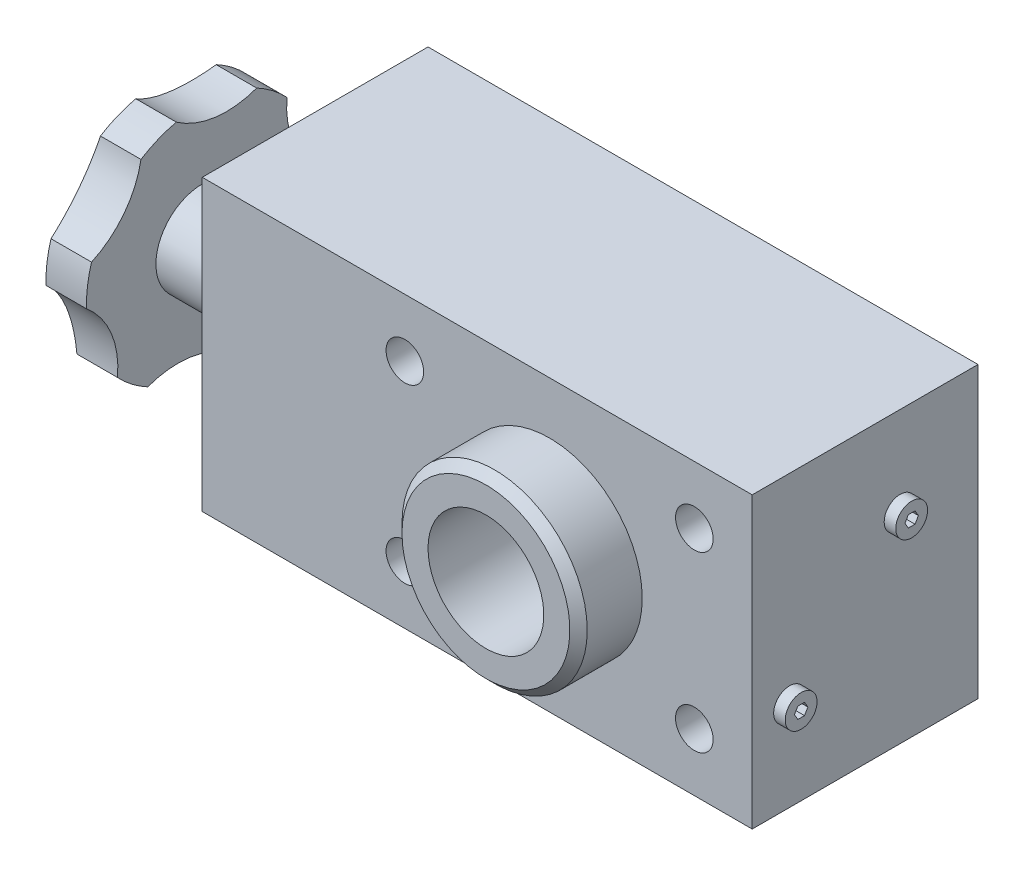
ISO-10303-21;
HEADER;
FILE_DESCRIPTION(('STEP AP214'),'2;1');
FILE_NAME('part.step','',(''),(''),'','','');
FILE_SCHEMA(('AUTOMOTIVE_DESIGN { 1 0 10303 214 1 1 1 1 }'));
ENDSEC;
DATA;
#1=APPLICATION_CONTEXT('core data for automotive mechanical design processes');
#2=APPLICATION_PROTOCOL_DEFINITION('international standard','automotive_design',2000,#1);
#3=PRODUCT_CONTEXT('',#1,'mechanical');
#4=PRODUCT('Part','Part','',(#3));
#5=PRODUCT_RELATED_PRODUCT_CATEGORY('part','',(#4));
#6=PRODUCT_DEFINITION_FORMATION('','',#4);
#7=PRODUCT_DEFINITION_CONTEXT('part definition',#1,'design');
#8=PRODUCT_DEFINITION('design','',#6,#7);
#9=PRODUCT_DEFINITION_SHAPE('','',#8);
#10=(LENGTH_UNIT() NAMED_UNIT(*) SI_UNIT(.MILLI.,.METRE.));
#11=(NAMED_UNIT(*) PLANE_ANGLE_UNIT() SI_UNIT($,.RADIAN.));
#12=(NAMED_UNIT(*) SI_UNIT($,.STERADIAN.) SOLID_ANGLE_UNIT());
#13=UNCERTAINTY_MEASURE_WITH_UNIT(LENGTH_MEASURE(1.E-05),#10,'distance_accuracy_value','');
#14=(GEOMETRIC_REPRESENTATION_CONTEXT(3) GLOBAL_UNCERTAINTY_ASSIGNED_CONTEXT((#13)) GLOBAL_UNIT_ASSIGNED_CONTEXT((#10,
#11,#12)) REPRESENTATION_CONTEXT('',''));
#15=CARTESIAN_POINT('',(0.,0.,0.));
#16=DIRECTION('',(0.,0.,1.));
#17=DIRECTION('',(1.,0.,0.));
#18=AXIS2_PLACEMENT_3D('',#15,#16,#17);
#19=CARTESIAN_POINT('',(-35.,40.,39.));
#20=DIRECTION('',(1.,0.,0.));
#21=DIRECTION('',(0.,0.,1.));
#22=AXIS2_PLACEMENT_3D('',#19,#20,#21);
#23=PLANE('',#22);
#24=DIRECTION('',(0.,-1.,0.));
#25=VECTOR('',#24,1.);
#26=CARTESIAN_POINT('',(-35.,40.,0.));
#27=LINE('',#26,#25);
#28=CARTESIAN_POINT('',(-35.,40.,0.));
#29=VERTEX_POINT('',#28);
#30=CARTESIAN_POINT('',(-35.,-10.,0.));
#31=VERTEX_POINT('',#30);
#32=EDGE_CURVE('E474',#29,#31,#27,.T.);
#33=ORIENTED_EDGE('',*,*,#32,.T.);
#34=DIRECTION('',(0.,0.,-1.));
#35=VECTOR('',#34,1.);
#36=CARTESIAN_POINT('',(-35.,-10.,39.));
#37=LINE('',#36,#35);
#38=CARTESIAN_POINT('',(-35.,-10.,39.));
#39=VERTEX_POINT('',#38);
#40=EDGE_CURVE('E480',#39,#31,#37,.T.);
#41=ORIENTED_EDGE('',*,*,#40,.F.);
#42=DIRECTION('',(0.,-1.,0.));
#43=VECTOR('',#42,1.);
#44=CARTESIAN_POINT('',(-35.,40.,39.));
#45=LINE('',#44,#43);
#46=CARTESIAN_POINT('',(-35.,40.,39.));
#47=VERTEX_POINT('',#46);
#48=EDGE_CURVE('E479',#47,#39,#45,.T.);
#49=ORIENTED_EDGE('',*,*,#48,.F.);
#50=DIRECTION('',(0.,0.,-1.));
#51=VECTOR('',#50,1.);
#52=CARTESIAN_POINT('',(-35.,40.,39.));
#53=LINE('',#52,#51);
#54=EDGE_CURVE('E466',#47,#29,#53,.T.);
#55=ORIENTED_EDGE('',*,*,#54,.T.);
#56=EDGE_LOOP('',(#33,#41,#49,#55));
#57=FACE_BOUND('',#56,.T.);
#58=CARTESIAN_POINT('',(-35.,15.,23.));
#59=DIRECTION('',(1.,0.,0.));
#60=DIRECTION('',(0.,0.,1.));
#61=AXIS2_PLACEMENT_3D('',#58,#59,#60);
#62=CIRCLE('',#61,8.);
#63=CARTESIAN_POINT('',(-35.,15.,31.));
#64=VERTEX_POINT('',#63);
#65=EDGE_CURVE('E521',#64,#64,#62,.F.);
#66=ORIENTED_EDGE('',*,*,#65,.F.);
#67=EDGE_LOOP('',(#66));
#68=FACE_BOUND('',#67,.T.);
#69=ADVANCED_FACE('F14',(#57,#68),#23,.F.);
#70=CARTESIAN_POINT('',(-35.,15.,23.));
#71=DIRECTION('',(-1.,0.,0.));
#72=DIRECTION('',(0.,0.,-1.));
#73=AXIS2_PLACEMENT_3D('',#70,#71,#72);
#74=CIRCLE('',#73,5.25);
#75=CARTESIAN_POINT('',(-35.,15.,17.75));
#76=VERTEX_POINT('',#75);
#77=EDGE_CURVE('E606',#76,#76,#74,.T.);
#78=ORIENTED_EDGE('',*,*,#77,.F.);
#79=EDGE_LOOP('',(#78));
#80=FACE_BOUND('',#79,.T.);
#81=CARTESIAN_POINT('',(-35.,15.,23.));
#82=DIRECTION('',(1.,0.,0.));
#83=DIRECTION('',(0.,0.,1.));
#84=AXIS2_PLACEMENT_3D('',#81,#82,#83);
#85=CIRCLE('',#84,6.25);
#86=CARTESIAN_POINT('',(-35.,15.,29.25));
#87=VERTEX_POINT('',#86);
#88=EDGE_CURVE('E510',#87,#87,#85,.T.);
#89=ORIENTED_EDGE('',*,*,#88,.F.);
#90=EDGE_LOOP('',(#89));
#91=FACE_BOUND('',#90,.T.);
#92=ADVANCED_FACE('F436',(#80,#91),#23,.F.);
#93=CARTESIAN_POINT('',(57.,15.,23.));
#94=DIRECTION('',(-1.,0.,0.));
#95=DIRECTION('',(0.,0.145988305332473,-0.989286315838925));
#96=AXIS2_PLACEMENT_3D('',#93,#94,#95);
#97=PLANE('',#96);
#98=CARTESIAN_POINT('',(57.,15.,23.));
#99=DIRECTION('',(1.,0.,0.));
#100=DIRECTION('',(0.,0.,1.));
#101=AXIS2_PLACEMENT_3D('',#98,#99,#100);
#102=CIRCLE('',#101,9.);
#103=CARTESIAN_POINT('',(57.,15.,32.));
#104=VERTEX_POINT('',#103);
#105=EDGE_CURVE('E601',#104,#104,#102,.T.);
#106=ORIENTED_EDGE('',*,*,#105,.F.);
#107=EDGE_LOOP('',(#106));
#108=FACE_BOUND('',#107,.T.);
#109=ADVANCED_FACE('F415',(#108),#97,.T.);
#110=CARTESIAN_POINT('',(60.,15.,23.));
#111=DIRECTION('',(-1.,0.,0.));
#112=DIRECTION('',(0.,0.,-1.));
#113=AXIS2_PLACEMENT_3D('',#110,#111,#112);
#114=CYLINDRICAL_SURFACE('',#113,5.25);
#115=ORIENTED_EDGE('',*,*,#77,.T.);
#116=EDGE_LOOP('',(#115));
#117=FACE_BOUND('',#116,.T.);
#118=CARTESIAN_POINT('',(-27.9012909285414,15.,23.));
#119=DIRECTION('',(1.,0.,0.));
#120=DIRECTION('',(0.,0.,1.));
#121=AXIS2_PLACEMENT_3D('',#118,#119,#120);
#122=CIRCLE('',#121,5.25);
#123=CARTESIAN_POINT('',(-27.9012909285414,15.,28.25));
#124=VERTEX_POINT('',#123);
#125=EDGE_CURVE('E511',#124,#124,#122,.F.);
#126=ORIENTED_EDGE('',*,*,#125,.F.);
#127=EDGE_LOOP('',(#126));
#128=FACE_BOUND('',#127,.T.);
#129=ADVANCED_FACE('F444',(#117,#128),#114,.F.);
#130=CARTESIAN_POINT('',(-27.,15.,23.));
#131=DIRECTION('',(1.,0.,0.));
#132=DIRECTION('',(0.,0.,1.));
#133=AXIS2_PLACEMENT_3D('',#130,#131,#132);
#134=CONICAL_SURFACE('',#133,6.75,1.02974425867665);
#135=CARTESIAN_POINT('',(-27.,15.,23.));
#136=DIRECTION('',(-1.,0.,0.));
#137=DIRECTION('',(0.,0.,-1.));
#138=AXIS2_PLACEMENT_3D('',#135,#136,#137);
#139=CIRCLE('',#138,6.75);
#140=CARTESIAN_POINT('',(-27.,15.,16.25));
#141=VERTEX_POINT('',#140);
#142=EDGE_CURVE('E515',#141,#141,#139,.T.);
#143=ORIENTED_EDGE('',*,*,#142,.F.);
#144=EDGE_LOOP('',(#143));
#145=FACE_BOUND('',#144,.T.);
#146=ORIENTED_EDGE('',*,*,#125,.T.);
#147=EDGE_LOOP('',(#146));
#148=FACE_BOUND('',#147,.T.);
#149=ADVANCED_FACE('F937',(#145,#148),#134,.F.);
#150=CARTESIAN_POINT('',(25.,15.,50.));
#151=DIRECTION('',(0.,0.,-1.));
#152=DIRECTION('',(1.,0.,0.));
#153=AXIS2_PLACEMENT_3D('',#150,#151,#152);
#154=CYLINDRICAL_SURFACE('',#153,16.);
#155=CARTESIAN_POINT('',(25.,15.,48.5));
#156=DIRECTION('',(0.,0.,1.));
#157=DIRECTION('',(-1.,0.,0.));
#158=AXIS2_PLACEMENT_3D('',#155,#156,#157);
#159=CIRCLE('',#158,16.);
#160=CARTESIAN_POINT('',(9.,15.,48.5));
#161=VERTEX_POINT('',#160);
#162=EDGE_CURVE('E507',#161,#161,#159,.F.);
#163=ORIENTED_EDGE('',*,*,#162,.T.);
#164=EDGE_LOOP('',(#163));
#165=FACE_BOUND('',#164,.T.);
#166=CARTESIAN_POINT('',(25.,15.,39.));
#167=DIRECTION('',(0.,0.,-1.));
#168=DIRECTION('',(1.,0.,0.));
#169=AXIS2_PLACEMENT_3D('',#166,#167,#168);
#170=CIRCLE('',#169,16.);
#171=CARTESIAN_POINT('',(41.,15.,39.));
#172=VERTEX_POINT('',#171);
#173=EDGE_CURVE('E501',#172,#172,#170,.F.);
#174=ORIENTED_EDGE('',*,*,#173,.T.);
#175=EDGE_LOOP('',(#174));
#176=FACE_BOUND('',#175,.T.);
#177=ADVANCED_FACE('F929',(#165,#176),#154,.T.);
#178=CARTESIAN_POINT('',(50.,0.,0.));
#179=DIRECTION('',(0.,0.,1.));
#180=DIRECTION('',(-1.,0.,0.));
#181=AXIS2_PLACEMENT_3D('',#178,#179,#180);
#182=CYLINDRICAL_SURFACE('',#181,3.25);
#183=CARTESIAN_POINT('',(50.,0.,0.));
#184=DIRECTION('',(0.,0.,1.));
#185=DIRECTION('',(-1.,0.,0.));
#186=AXIS2_PLACEMENT_3D('',#183,#184,#185);
#187=CIRCLE('',#186,3.25);
#188=CARTESIAN_POINT('',(46.75,0.,0.));
#189=VERTEX_POINT('',#188);
#190=EDGE_CURVE('E609',#189,#189,#187,.T.);
#191=ORIENTED_EDGE('',*,*,#190,.F.);
#192=EDGE_LOOP('',(#191));
#193=FACE_BOUND('',#192,.T.);
#194=CARTESIAN_POINT('',(50.,0.,39.));
#195=DIRECTION('',(0.,0.,1.));
#196=DIRECTION('',(-1.,0.,0.));
#197=AXIS2_PLACEMENT_3D('',#194,#195,#196);
#198=CIRCLE('',#197,3.25);
#199=CARTESIAN_POINT('',(46.75,0.,39.));
#200=VERTEX_POINT('',#199);
#201=EDGE_CURVE('E612',#200,#200,#198,.T.);
#202=ORIENTED_EDGE('',*,*,#201,.T.);
#203=EDGE_LOOP('',(#202));
#204=FACE_BOUND('',#203,.T.);
#205=ADVANCED_FACE('F921',(#193,#204),#182,.F.);
#206=CARTESIAN_POINT('',(50.,30.,0.));
#207=DIRECTION('',(0.,0.,1.));
#208=DIRECTION('',(-1.,0.,0.));
#209=AXIS2_PLACEMENT_3D('',#206,#207,#208);
#210=CYLINDRICAL_SURFACE('',#209,3.25);
#211=CARTESIAN_POINT('',(50.,30.,0.));
#212=DIRECTION('',(0.,0.,1.));
#213=DIRECTION('',(1.,0.,0.));
#214=AXIS2_PLACEMENT_3D('',#211,#212,#213);
#215=CIRCLE('',#214,3.25);
#216=CARTESIAN_POINT('',(53.25,30.,0.));
#217=VERTEX_POINT('',#216);
#218=EDGE_CURVE('E615',#217,#217,#215,.T.);
#219=ORIENTED_EDGE('',*,*,#218,.F.);
#220=EDGE_LOOP('',(#219));
#221=FACE_BOUND('',#220,.T.);
#222=CARTESIAN_POINT('',(50.,30.,39.));
#223=DIRECTION('',(0.,0.,1.));
#224=DIRECTION('',(1.,0.,0.));
#225=AXIS2_PLACEMENT_3D('',#222,#223,#224);
#226=CIRCLE('',#225,3.25);
#227=CARTESIAN_POINT('',(53.25,30.,39.));
#228=VERTEX_POINT('',#227);
#229=EDGE_CURVE('E618',#228,#228,#226,.T.);
#230=ORIENTED_EDGE('',*,*,#229,.T.);
#231=EDGE_LOOP('',(#230));
#232=FACE_BOUND('',#231,.T.);
#233=ADVANCED_FACE('F913',(#221,#232),#210,.F.);
#234=CARTESIAN_POINT('',(0.,0.,0.));
#235=DIRECTION('',(0.,0.,1.));
#236=DIRECTION('',(-1.,0.,0.));
#237=AXIS2_PLACEMENT_3D('',#234,#235,#236);
#238=CYLINDRICAL_SURFACE('',#237,3.25);
#239=CARTESIAN_POINT('',(0.,0.,0.));
#240=DIRECTION('',(0.,0.,1.));
#241=DIRECTION('',(-1.,0.,0.));
#242=AXIS2_PLACEMENT_3D('',#239,#240,#241);
#243=CIRCLE('',#242,3.25);
#244=CARTESIAN_POINT('',(-3.25,0.,0.));
#245=VERTEX_POINT('',#244);
#246=EDGE_CURVE('E621',#245,#245,#243,.T.);
#247=ORIENTED_EDGE('',*,*,#246,.F.);
#248=EDGE_LOOP('',(#247));
#249=FACE_BOUND('',#248,.T.);
#250=CARTESIAN_POINT('',(0.,0.,39.));
#251=DIRECTION('',(0.,0.,1.));
#252=DIRECTION('',(-1.,0.,0.));
#253=AXIS2_PLACEMENT_3D('',#250,#251,#252);
#254=CIRCLE('',#253,3.25);
#255=CARTESIAN_POINT('',(-3.25,0.,39.));
#256=VERTEX_POINT('',#255);
#257=EDGE_CURVE('E624',#256,#256,#254,.T.);
#258=ORIENTED_EDGE('',*,*,#257,.T.);
#259=EDGE_LOOP('',(#258));
#260=FACE_BOUND('',#259,.T.);
#261=ADVANCED_FACE('F905',(#249,#260),#238,.F.);
#262=CARTESIAN_POINT('',(0.,30.,0.));
#263=DIRECTION('',(0.,0.,1.));
#264=DIRECTION('',(-1.,0.,0.));
#265=AXIS2_PLACEMENT_3D('',#262,#263,#264);
#266=CYLINDRICAL_SURFACE('',#265,3.25);
#267=CARTESIAN_POINT('',(0.,30.,0.));
#268=DIRECTION('',(0.,0.,1.));
#269=DIRECTION('',(1.,0.,0.));
#270=AXIS2_PLACEMENT_3D('',#267,#268,#269);
#271=CIRCLE('',#270,3.25);
#272=CARTESIAN_POINT('',(3.25,30.,0.));
#273=VERTEX_POINT('',#272);
#274=EDGE_CURVE('E627',#273,#273,#271,.T.);
#275=ORIENTED_EDGE('',*,*,#274,.F.);
#276=EDGE_LOOP('',(#275));
#277=FACE_BOUND('',#276,.T.);
#278=CARTESIAN_POINT('',(0.,30.,39.));
#279=DIRECTION('',(0.,0.,1.));
#280=DIRECTION('',(1.,0.,0.));
#281=AXIS2_PLACEMENT_3D('',#278,#279,#280);
#282=CIRCLE('',#281,3.25);
#283=CARTESIAN_POINT('',(3.25,30.,39.));
#284=VERTEX_POINT('',#283);
#285=EDGE_CURVE('E518',#284,#284,#282,.T.);
#286=ORIENTED_EDGE('',*,*,#285,.T.);
#287=EDGE_LOOP('',(#286));
#288=FACE_BOUND('',#287,.T.);
#289=ADVANCED_FACE('F898',(#277,#288),#266,.F.);
#290=CARTESIAN_POINT('',(60.,-10.,39.));
#291=DIRECTION('',(0.,1.,0.));
#292=DIRECTION('',(0.,0.,-1.));
#293=AXIS2_PLACEMENT_3D('',#290,#291,#292);
#294=PLANE('',#293);
#295=DIRECTION('',(1.,0.,0.));
#296=VECTOR('',#295,1.);
#297=CARTESIAN_POINT('',(60.,-10.,0.));
#298=LINE('',#297,#296);
#299=CARTESIAN_POINT('',(60.,-10.,0.));
#300=VERTEX_POINT('',#299);
#301=EDGE_CURVE('E483',#31,#300,#298,.T.);
#302=ORIENTED_EDGE('',*,*,#301,.T.);
#303=DIRECTION('',(0.,0.,-1.));
#304=VECTOR('',#303,1.);
#305=CARTESIAN_POINT('',(60.,-10.,39.));
#306=LINE('',#305,#304);
#307=CARTESIAN_POINT('',(60.,-10.,39.));
#308=VERTEX_POINT('',#307);
#309=EDGE_CURVE('E496',#308,#300,#306,.T.);
#310=ORIENTED_EDGE('',*,*,#309,.F.);
#311=DIRECTION('',(1.,0.,0.));
#312=VECTOR('',#311,1.);
#313=CARTESIAN_POINT('',(60.,-10.,39.));
#314=LINE('',#313,#312);
#315=EDGE_CURVE('E494',#39,#308,#314,.T.);
#316=ORIENTED_EDGE('',*,*,#315,.F.);
#317=ORIENTED_EDGE('',*,*,#40,.T.);
#318=EDGE_LOOP('',(#302,#310,#316,#317));
#319=FACE_BOUND('',#318,.T.);
#320=ADVANCED_FACE('F447',(#319),#294,.F.);
#321=CARTESIAN_POINT('',(60.,-10.,39.));
#322=DIRECTION('',(0.,0.,-1.));
#323=DIRECTION('',(1.,0.,0.));
#324=AXIS2_PLACEMENT_3D('',#321,#322,#323);
#325=PLANE('',#324);
#326=ORIENTED_EDGE('',*,*,#285,.F.);
#327=EDGE_LOOP('',(#326));
#328=FACE_BOUND('',#327,.T.);
#329=ORIENTED_EDGE('',*,*,#257,.F.);
#330=EDGE_LOOP('',(#329));
#331=FACE_BOUND('',#330,.T.);
#332=ORIENTED_EDGE('',*,*,#229,.F.);
#333=EDGE_LOOP('',(#332));
#334=FACE_BOUND('',#333,.T.);
#335=ORIENTED_EDGE('',*,*,#201,.F.);
#336=EDGE_LOOP('',(#335));
#337=FACE_BOUND('',#336,.T.);
#338=DIRECTION('',(0.,1.,0.));
#339=VECTOR('',#338,1.);
#340=CARTESIAN_POINT('',(60.,40.,39.));
#341=LINE('',#340,#339);
#342=CARTESIAN_POINT('',(60.,40.,39.));
#343=VERTEX_POINT('',#342);
#344=EDGE_CURVE('E485',#308,#343,#341,.T.);
#345=ORIENTED_EDGE('',*,*,#344,.T.);
#346=DIRECTION('',(-1.,0.,0.));
#347=VECTOR('',#346,1.);
#348=CARTESIAN_POINT('',(60.,40.,39.));
#349=LINE('',#348,#347);
#350=EDGE_CURVE('E491',#343,#47,#349,.T.);
#351=ORIENTED_EDGE('',*,*,#350,.T.);
#352=ORIENTED_EDGE('',*,*,#48,.T.);
#353=ORIENTED_EDGE('',*,*,#315,.T.);
#354=EDGE_LOOP('',(#345,#351,#352,#353));
#355=FACE_BOUND('',#354,.T.);
#356=ORIENTED_EDGE('',*,*,#173,.F.);
#357=EDGE_LOOP('',(#356));
#358=FACE_BOUND('',#357,.T.);
#359=ADVANCED_FACE('F452',(#328,#331,#334,#337,#355,#358),#325,.F.);
#360=CARTESIAN_POINT('',(60.,40.,39.));
#361=DIRECTION('',(0.,-1.,0.));
#362=DIRECTION('',(0.,0.,1.));
#363=AXIS2_PLACEMENT_3D('',#360,#361,#362);
#364=PLANE('',#363);
#365=DIRECTION('',(-1.,0.,0.));
#366=VECTOR('',#365,1.);
#367=CARTESIAN_POINT('',(60.,40.,0.));
#368=LINE('',#367,#366);
#369=CARTESIAN_POINT('',(60.,40.,0.));
#370=VERTEX_POINT('',#369);
#371=EDGE_CURVE('E464',#370,#29,#368,.T.);
#372=ORIENTED_EDGE('',*,*,#371,.T.);
#373=ORIENTED_EDGE('',*,*,#54,.F.);
#374=ORIENTED_EDGE('',*,*,#350,.F.);
#375=DIRECTION('',(0.,0.,-1.));
#376=VECTOR('',#375,1.);
#377=CARTESIAN_POINT('',(60.,40.,39.));
#378=LINE('',#377,#376);
#379=EDGE_CURVE('E469',#343,#370,#378,.T.);
#380=ORIENTED_EDGE('',*,*,#379,.T.);
#381=EDGE_LOOP('',(#372,#373,#374,#380));
#382=FACE_BOUND('',#381,.T.);
#383=ADVANCED_FACE('F449',(#382),#364,.F.);
#384=CARTESIAN_POINT('',(60.,-10.,0.));
#385=DIRECTION('',(0.,0.,-1.));
#386=DIRECTION('',(1.,0.,0.));
#387=AXIS2_PLACEMENT_3D('',#384,#385,#386);
#388=PLANE('',#387);
#389=ORIENTED_EDGE('',*,*,#274,.T.);
#390=EDGE_LOOP('',(#389));
#391=FACE_BOUND('',#390,.T.);
#392=ORIENTED_EDGE('',*,*,#246,.T.);
#393=EDGE_LOOP('',(#392));
#394=FACE_BOUND('',#393,.T.);
#395=ORIENTED_EDGE('',*,*,#218,.T.);
#396=EDGE_LOOP('',(#395));
#397=FACE_BOUND('',#396,.T.);
#398=ORIENTED_EDGE('',*,*,#190,.T.);
#399=EDGE_LOOP('',(#398));
#400=FACE_BOUND('',#399,.T.);
#401=DIRECTION('',(0.,1.,0.));
#402=VECTOR('',#401,1.);
#403=CARTESIAN_POINT('',(60.,40.,0.));
#404=LINE('',#403,#402);
#405=EDGE_CURVE('E475',#300,#370,#404,.T.);
#406=ORIENTED_EDGE('',*,*,#405,.F.);
#407=ORIENTED_EDGE('',*,*,#301,.F.);
#408=ORIENTED_EDGE('',*,*,#32,.F.);
#409=ORIENTED_EDGE('',*,*,#371,.F.);
#410=EDGE_LOOP('',(#406,#407,#408,#409));
#411=FACE_BOUND('',#410,.T.);
#412=ADVANCED_FACE('F451',(#391,#394,#397,#400,#411),#388,.T.);
#413=CARTESIAN_POINT('',(60.,40.,39.));
#414=DIRECTION('',(-1.,0.,0.));
#415=DIRECTION('',(0.,0.,-1.));
#416=AXIS2_PLACEMENT_3D('',#413,#414,#415);
#417=PLANE('',#416);
#418=CARTESIAN_POINT('',(60.,5.4540584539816,32.5459415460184));
#419=DIRECTION('',(-1.,0.,0.));
#420=DIRECTION('',(0.,0.,1.));
#421=AXIS2_PLACEMENT_3D('',#418,#419,#420);
#422=CIRCLE('',#421,2.75);
#423=CARTESIAN_POINT('',(60.,5.4540584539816,35.2959415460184));
#424=VERTEX_POINT('',#423);
#425=EDGE_CURVE('E9',#424,#424,#422,.F.);
#426=ORIENTED_EDGE('',*,*,#425,.F.);
#427=EDGE_LOOP('',(#426));
#428=FACE_BOUND('',#427,.T.);
#429=CARTESIAN_POINT('',(60.,24.5459415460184,13.4540584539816));
#430=DIRECTION('',(-1.,0.,0.));
#431=DIRECTION('',(0.,0.,1.));
#432=AXIS2_PLACEMENT_3D('',#429,#430,#431);
#433=CIRCLE('',#432,2.75);
#434=CARTESIAN_POINT('',(60.,24.5459415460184,16.2040584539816));
#435=VERTEX_POINT('',#434);
#436=EDGE_CURVE('E22',#435,#435,#433,.F.);
#437=ORIENTED_EDGE('',*,*,#436,.F.);
#438=EDGE_LOOP('',(#437));
#439=FACE_BOUND('',#438,.T.);
#440=ORIENTED_EDGE('',*,*,#405,.T.);
#441=ORIENTED_EDGE('',*,*,#379,.F.);
#442=ORIENTED_EDGE('',*,*,#344,.F.);
#443=ORIENTED_EDGE('',*,*,#309,.T.);
#444=EDGE_LOOP('',(#440,#441,#442,#443));
#445=FACE_BOUND('',#444,.T.);
#446=ADVANCED_FACE('F16',(#428,#439,#445),#417,.F.);
#447=CARTESIAN_POINT('',(25.,15.,50.));
#448=DIRECTION('',(0.,0.,-1.));
#449=DIRECTION('',(1.,0.,0.));
#450=AXIS2_PLACEMENT_3D('',#447,#448,#449);
#451=CONICAL_SURFACE('',#450,14.5,0.785398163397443);
#452=ORIENTED_EDGE('',*,*,#162,.F.);
#453=EDGE_LOOP('',(#452));
#454=FACE_BOUND('',#453,.T.);
#455=CARTESIAN_POINT('',(25.,15.,50.));
#456=DIRECTION('',(0.,0.,1.));
#457=DIRECTION('',(-1.,0.,0.));
#458=AXIS2_PLACEMENT_3D('',#455,#456,#457);
#459=CIRCLE('',#458,14.5);
#460=CARTESIAN_POINT('',(10.5,15.,50.));
#461=VERTEX_POINT('',#460);
#462=EDGE_CURVE('E504',#461,#461,#459,.T.);
#463=ORIENTED_EDGE('',*,*,#462,.F.);
#464=EDGE_LOOP('',(#463));
#465=FACE_BOUND('',#464,.T.);
#466=ADVANCED_FACE('F530',(#454,#465),#451,.T.);
#467=CARTESIAN_POINT('',(-34.5,15.,23.));
#468=DIRECTION('',(-1.,0.,0.));
#469=DIRECTION('',(0.,0.,-1.));
#470=AXIS2_PLACEMENT_3D('',#467,#468,#469);
#471=CYLINDRICAL_SURFACE('',#470,6.75);
#472=CARTESIAN_POINT('',(-19.5,15.,23.));
#473=DIRECTION('',(1.,0.,0.));
#474=DIRECTION('',(0.,0.,1.));
#475=AXIS2_PLACEMENT_3D('',#472,#473,#474);
#476=CIRCLE('',#475,6.75);
#477=CARTESIAN_POINT('',(-19.5,15.,29.75));
#478=VERTEX_POINT('',#477);
#479=EDGE_CURVE('E514',#478,#478,#476,.F.);
#480=ORIENTED_EDGE('',*,*,#479,.F.);
#481=EDGE_LOOP('',(#480));
#482=FACE_BOUND('',#481,.T.);
#483=ORIENTED_EDGE('',*,*,#142,.T.);
#484=EDGE_LOOP('',(#483));
#485=FACE_BOUND('',#484,.T.);
#486=ADVANCED_FACE('F573',(#482,#485),#471,.F.);
#487=CARTESIAN_POINT('',(25.,15.,50.));
#488=DIRECTION('',(0.,0.,1.));
#489=DIRECTION('',(-1.,0.,0.));
#490=AXIS2_PLACEMENT_3D('',#487,#488,#489);
#491=PLANE('',#490);
#492=ORIENTED_EDGE('',*,*,#462,.T.);
#493=EDGE_LOOP('',(#492));
#494=FACE_BOUND('',#493,.T.);
#495=CARTESIAN_POINT('',(25.,15.,50.));
#496=DIRECTION('',(0.,0.,1.));
#497=DIRECTION('',(-1.,0.,0.));
#498=AXIS2_PLACEMENT_3D('',#495,#496,#497);
#499=CIRCLE('',#498,10.);
#500=CARTESIAN_POINT('',(15.,15.,50.));
#501=VERTEX_POINT('',#500);
#502=EDGE_CURVE('E539',#501,#501,#499,.T.);
#503=ORIENTED_EDGE('',*,*,#502,.F.);
#504=EDGE_LOOP('',(#503));
#505=FACE_BOUND('',#504,.T.);
#506=ADVANCED_FACE('F584',(#494,#505),#491,.T.);
#507=CARTESIAN_POINT('',(-19.5,15.,23.));
#508=DIRECTION('',(1.,0.,0.));
#509=DIRECTION('',(0.,0.,1.));
#510=AXIS2_PLACEMENT_3D('',#507,#508,#509);
#511=PLANE('',#510);
#512=CARTESIAN_POINT('',(-19.5,15.,23.));
#513=DIRECTION('',(1.,0.,0.));
#514=DIRECTION('',(0.,0.,1.));
#515=AXIS2_PLACEMENT_3D('',#512,#513,#514);
#516=CIRCLE('',#515,9.);
#517=CARTESIAN_POINT('',(-19.5,15.,32.));
#518=VERTEX_POINT('',#517);
#519=EDGE_CURVE('E599',#518,#518,#516,.T.);
#520=ORIENTED_EDGE('',*,*,#519,.T.);
#521=EDGE_LOOP('',(#520));
#522=FACE_BOUND('',#521,.T.);
#523=ORIENTED_EDGE('',*,*,#479,.T.);
#524=EDGE_LOOP('',(#523));
#525=FACE_BOUND('',#524,.T.);
#526=ADVANCED_FACE('F569',(#522,#525),#511,.T.);
#527=CARTESIAN_POINT('',(25.,15.,20.));
#528=DIRECTION('',(0.,0.,1.));
#529=DIRECTION('',(-1.,0.,0.));
#530=AXIS2_PLACEMENT_3D('',#527,#528,#529);
#531=PLANE('',#530);
#532=DIRECTION('',(1.,0.,0.));
#533=VECTOR('',#532,1.);
#534=CARTESIAN_POINT('',(-19.5,23.4852813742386,20.));
#535=LINE('',#534,#533);
#536=CARTESIAN_POINT('',(30.2915026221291,23.4852813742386,20.));
#537=VERTEX_POINT('',#536);
#538=CARTESIAN_POINT('',(19.7084973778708,23.4852813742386,20.));
#539=VERTEX_POINT('',#538);
#540=EDGE_CURVE('E598',#537,#539,#535,.F.);
#541=ORIENTED_EDGE('',*,*,#540,.F.);
#542=CARTESIAN_POINT('',(25.,15.,20.));
#543=DIRECTION('',(0.,0.,1.));
#544=DIRECTION('',(-1.,0.,0.));
#545=AXIS2_PLACEMENT_3D('',#542,#543,#544);
#546=CIRCLE('',#545,10.);
#547=EDGE_CURVE('E536',#537,#539,#546,.T.);
#548=ORIENTED_EDGE('',*,*,#547,.T.);
#549=EDGE_LOOP('',(#541,#548));
#550=FACE_BOUND('',#549,.T.);
#551=ADVANCED_FACE('F575',(#550),#531,.T.);
#552=CARTESIAN_POINT('',(25.,15.,20.));
#553=DIRECTION('',(0.,0.,1.));
#554=DIRECTION('',(-1.,0.,0.));
#555=AXIS2_PLACEMENT_3D('',#552,#553,#554);
#556=CYLINDRICAL_SURFACE('',#555,10.);
#557=CARTESIAN_POINT('',(19.7084973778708,6.51471862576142,20.));
#558=VERTEX_POINT('',#557);
#559=CARTESIAN_POINT('',(30.2915026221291,6.51471862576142,20.));
#560=VERTEX_POINT('',#559);
#561=EDGE_CURVE('E534',#558,#560,#546,.T.);
#562=ORIENTED_EDGE('',*,*,#561,.F.);
#563=CARTESIAN_POINT('',(19.7084973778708,6.51471862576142,20.));
#564=CARTESIAN_POINT('',(19.7762895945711,6.47242753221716,20.1196549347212));
#565=CARTESIAN_POINT('',(19.8424231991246,6.4323300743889,20.2410865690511));
#566=CARTESIAN_POINT('',(19.9701942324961,6.35670725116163,20.4879776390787));
#567=CARTESIAN_POINT('',(20.0318230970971,6.32119050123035,20.6134441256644));
#568=CARTESIAN_POINT('',(20.1500719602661,6.2545500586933,20.8704528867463));
#569=CARTESIAN_POINT('',(20.2065973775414,6.22350468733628,21.0020598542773));
#570=CARTESIAN_POINT('',(20.3117422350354,6.16689235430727,21.2694171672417));
#571=CARTESIAN_POINT('',(20.3603666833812,6.14132191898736,21.4051648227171));
#572=CARTESIAN_POINT('',(20.475944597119,6.0815051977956,21.7699349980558));
#573=CARTESIAN_POINT('',(20.5345146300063,6.05228814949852,22.0026883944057));
#574=CARTESIAN_POINT('',(20.5954201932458,6.02224076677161,22.3567059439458));
#575=CARTESIAN_POINT('',(20.6112231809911,6.01452399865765,22.4751718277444));
#576=CARTESIAN_POINT('',(20.6332774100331,6.0037844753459,22.7131817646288));
#577=CARTESIAN_POINT('',(20.6395330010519,6.00075958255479,22.832725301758));
#578=CARTESIAN_POINT('',(20.6421550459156,5.99948939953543,23.072597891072));
#579=CARTESIAN_POINT('',(20.6384676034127,6.00127015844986,23.1929276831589));
#580=CARTESIAN_POINT('',(20.62131492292,6.00960538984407,23.4326931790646));
#581=CARTESIAN_POINT('',(20.6078493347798,6.01616003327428,23.5521288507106));
#582=CARTESIAN_POINT('',(20.5536090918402,6.04280698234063,23.9085054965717));
#583=CARTESIAN_POINT('',(20.4989894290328,6.06988425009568,24.1429179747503));
#584=CARTESIAN_POINT('',(20.3788744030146,6.13160295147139,24.5433629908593));
#585=CARTESIAN_POINT('',(20.3194497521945,6.16269525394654,24.7119185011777));
#586=CARTESIAN_POINT('',(20.1886325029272,6.23322858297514,25.0426124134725));
#587=CARTESIAN_POINT('',(20.1172323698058,6.27267486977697,25.2047466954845));
#588=CARTESIAN_POINT('',(19.9654566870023,6.35933895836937,25.5231552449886));
#589=CARTESIAN_POINT('',(19.8850550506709,6.40657954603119,25.6794106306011));
#590=CARTESIAN_POINT('',(19.7179225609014,6.50828289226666,25.9861056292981));
#591=CARTESIAN_POINT('',(19.6311894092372,6.56274827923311,26.1365430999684));
#592=CARTESIAN_POINT('',(19.3796425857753,6.72660277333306,26.5546190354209));
#593=CARTESIAN_POINT('',(19.2097082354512,6.84409199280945,26.816027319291));
#594=CARTESIAN_POINT('',(18.8634567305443,7.10129476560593,27.323345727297));
#595=CARTESIAN_POINT('',(18.6871349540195,7.24102467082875,27.5692442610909));
#596=CARTESIAN_POINT('',(18.3336382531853,7.54254763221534,28.046385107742));
#597=CARTESIAN_POINT('',(18.1564635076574,7.70433624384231,28.277630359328));
#598=CARTESIAN_POINT('',(17.8054933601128,8.05019623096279,28.725398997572));
#599=CARTESIAN_POINT('',(17.6316964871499,8.23425764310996,28.941928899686));
#600=CARTESIAN_POINT('',(17.3204573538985,8.59136124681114,29.3233932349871));
#601=CARTESIAN_POINT('',(17.181916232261,8.76082557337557,29.4907840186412));
#602=CARTESIAN_POINT('',(16.9115727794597,9.11552364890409,29.8139930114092));
#603=CARTESIAN_POINT('',(16.7797707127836,9.30075801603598,29.9698107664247));
#604=CARTESIAN_POINT('',(16.5251902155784,9.68671863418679,30.268318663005));
#605=CARTESIAN_POINT('',(16.4023969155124,9.88741818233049,30.411030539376));
#606=CARTESIAN_POINT('',(16.1677637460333,10.304386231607,30.6819910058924));
#607=CARTESIAN_POINT('',(16.0559209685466,10.5206505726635,30.8102434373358));
#608=CARTESIAN_POINT('',(15.8686955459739,10.9187721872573,31.0238859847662));
#609=CARTESIAN_POINT('',(15.7907138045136,11.0976893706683,31.1124888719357));
#610=CARTESIAN_POINT('',(15.6439024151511,11.4641304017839,31.2787732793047));
#611=CARTESIAN_POINT('',(15.5750706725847,11.6516522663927,31.3564572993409));
#612=CARTESIAN_POINT('',(15.4476813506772,12.0345486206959,31.4998750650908));
#613=CARTESIAN_POINT('',(15.389120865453,12.2299208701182,31.5656121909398));
#614=CARTESIAN_POINT('',(15.2833204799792,12.627562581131,31.6841566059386));
#615=CARTESIAN_POINT('',(15.2360807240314,12.8298321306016,31.736963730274));
#616=CARTESIAN_POINT('',(15.1535884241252,13.2414370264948,31.8290567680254));
#617=CARTESIAN_POINT('',(15.1184248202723,13.4508128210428,31.8682423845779));
#618=CARTESIAN_POINT('',(15.0613523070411,13.8736002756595,31.9317922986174));
#619=CARTESIAN_POINT('',(15.0394434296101,14.0870119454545,31.9561565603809));
#620=CARTESIAN_POINT('',(15.0094119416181,14.5159096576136,31.9895440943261));
#621=CARTESIAN_POINT('',(15.0012834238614,14.7313947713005,31.99857393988));
#622=CARTESIAN_POINT('',(14.9989979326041,15.1625195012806,32.0011134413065));
#623=CARTESIAN_POINT('',(15.0048396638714,15.3781591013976,31.9946245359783));
#624=CARTESIAN_POINT('',(15.0288946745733,15.7832297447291,31.9678854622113));
#625=CARTESIAN_POINT('',(15.0456307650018,15.9728612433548,31.9492783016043));
#626=CARTESIAN_POINT('',(15.089651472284,16.3494195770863,31.9002878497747));
#627=CARTESIAN_POINT('',(15.1169395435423,16.5363455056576,31.8699007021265));
#628=CARTESIAN_POINT('',(15.1815608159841,16.906169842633,31.7978407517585));
#629=CARTESIAN_POINT('',(15.2188910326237,17.0890694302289,31.7561713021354));
#630=CARTESIAN_POINT('',(15.3029831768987,17.4499410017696,31.6621347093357));
#631=CARTESIAN_POINT('',(15.3497486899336,17.6279110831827,31.6097634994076));
#632=CARTESIAN_POINT('',(15.453600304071,17.9835613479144,31.4932014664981));
#633=CARTESIAN_POINT('',(15.5109659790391,18.161054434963,31.4286892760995));
#634=CARTESIAN_POINT('',(15.6341078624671,18.5091599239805,31.2898106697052));
#635=CARTESIAN_POINT('',(15.699887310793,18.6797696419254,31.2154404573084));
#636=CARTESIAN_POINT('',(15.9085434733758,19.1804240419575,30.9787329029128));
#637=CARTESIAN_POINT('',(16.0627894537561,19.4994657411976,30.8027412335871));
#638=CARTESIAN_POINT('',(16.3534799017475,20.0304624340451,30.4677578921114));
#639=CARTESIAN_POINT('',(16.4849376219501,20.2494264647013,30.3152723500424));
#640=CARTESIAN_POINT('',(16.7583386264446,20.6690079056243,29.9951361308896));
#641=CARTESIAN_POINT('',(16.9002829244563,20.8696235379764,29.8274839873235));
#642=CARTESIAN_POINT('',(17.1924622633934,21.2530512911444,29.4781823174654));
#643=CARTESIAN_POINT('',(17.3427206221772,21.4358089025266,29.2964927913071));
#644=CARTESIAN_POINT('',(17.6485876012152,21.7830855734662,28.9207421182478));
#645=CARTESIAN_POINT('',(17.8041952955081,21.947607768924,28.7266831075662));
#646=CARTESIAN_POINT('',(18.1218219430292,22.2623547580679,28.3221630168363));
#647=CARTESIAN_POINT('',(18.2839058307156,22.4121578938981,28.1114253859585));
#648=CARTESIAN_POINT('',(18.6078616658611,22.693279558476,27.67763786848));
#649=CARTESIAN_POINT('',(18.7697335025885,22.8245906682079,27.4545830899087));
#650=CARTESIAN_POINT('',(19.0888027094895,23.0683278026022,26.996164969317));
#651=CARTESIAN_POINT('',(19.2460109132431,23.1808009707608,26.760834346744));
#652=CARTESIAN_POINT('',(19.5505184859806,23.3867047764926,26.2760508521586));
#653=CARTESIAN_POINT('',(19.6978271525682,23.4801534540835,26.0266116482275));
#654=CARTESIAN_POINT('',(19.962656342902,23.6398518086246,25.5326989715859));
#655=CARTESIAN_POINT('',(20.08163748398,23.7077219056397,25.2895527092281));
#656=CARTESIAN_POINT('',(20.2941151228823,23.8243590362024,24.7879634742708));
#657=CARTESIAN_POINT('',(20.3876508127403,23.8731554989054,24.5295447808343));
#658=CARTESIAN_POINT('',(20.5239146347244,23.9425806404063,24.039780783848));
#659=CARTESIAN_POINT('',(20.572317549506,23.9664310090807,23.8105637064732));
#660=CARTESIAN_POINT('',(20.6181268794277,23.9888501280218,23.4627316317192));
#661=CARTESIAN_POINT('',(20.6289331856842,23.9940984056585,23.3462303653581));
#662=CARTESIAN_POINT('',(20.6412028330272,24.0000527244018,23.1125997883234));
#663=CARTESIAN_POINT('',(20.6426664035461,24.0007588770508,22.9954704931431));
#664=CARTESIAN_POINT('',(20.6361534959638,23.9976026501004,22.7616666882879));
#665=CARTESIAN_POINT('',(20.6281872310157,23.9937452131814,22.6449918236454));
#666=CARTESIAN_POINT('',(20.6032490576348,23.9815792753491,22.4128247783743));
#667=CARTESIAN_POINT('',(20.5862731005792,23.9732687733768,22.2973331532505));
#668=CARTESIAN_POINT('',(20.5226939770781,23.9418124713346,21.9524511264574));
#669=CARTESIAN_POINT('',(20.4634864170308,23.9121613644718,21.7258849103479));
#670=CARTESIAN_POINT('',(20.3482991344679,23.8523471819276,21.370703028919));
#671=CARTESIAN_POINT('',(20.3001581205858,23.826944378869,21.2385167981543));
#672=CARTESIAN_POINT('',(20.1964719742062,23.7709521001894,20.9780932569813));
#673=CARTESIAN_POINT('',(20.1409225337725,23.74035960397,20.8498582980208));
#674=CARTESIAN_POINT('',(20.0248984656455,23.6748327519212,20.5991991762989));
#675=CARTESIAN_POINT('',(19.9645068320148,23.6399677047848,20.4767177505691));
#676=CARTESIAN_POINT('',(19.839433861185,23.565856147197,20.2355960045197));
#677=CARTESIAN_POINT('',(19.774759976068,23.5266171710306,20.116949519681));
#678=CARTESIAN_POINT('',(19.7084973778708,23.4852813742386,20.));
#679=B_SPLINE_CURVE_WITH_KNOTS('',3,(#563,#564,#565,#566,#567,#568,#569,#570,#571,#572,#573,
#574,#575,#576,#577,#578,#579,#580,#581,#582,#583,#584,#585,#586,#587,#588,#589,#590,#591,#592,
#593,#594,#595,#596,#597,#598,#599,#600,#601,#602,#603,#604,#605,#606,#607,#608,#609,#610,#611,
#612,#613,#614,#615,#616,#617,#618,#619,#620,#621,#622,#623,#624,#625,#626,#627,#628,#629,#630,
#631,#632,#633,#634,#635,#636,#637,#638,#639,#640,#641,#642,#643,#644,#645,#646,#647,#648,#649,
#650,#651,#652,#653,#654,#655,#656,#657,#658,#659,#660,#661,#662,#663,#664,#665,#666,#667,#668,
#669,#670,#671,#672,#673,#674,#675,#676,#677,#678),.UNSPECIFIED.,.F.,.F.,(4,2,2,2,2,2,2,2,2,2,2,
2,2,2,2,2,2,2,2,2,2,2,2,2,2,2,2,2,2,2,2,2,2,2,2,2,2,2,2,2,2,2,2,2,2,2,2,2,2,2,2,2,2,2,2,2,2,4),
(0.,0.431677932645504,0.864156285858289,1.30347128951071,1.74250673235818,2.46448911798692,
2.82338115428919,3.18210963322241,3.54278650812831,3.90347629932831,4.62662492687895,
5.17016216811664,5.71404268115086,6.25954230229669,6.80524092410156,7.80333611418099,
8.80216854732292,9.80080002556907,10.7989864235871,11.6249532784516,12.4509525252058,
13.2755562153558,14.0999403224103,14.7423852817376,15.3846829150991,16.02679853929,
16.6689223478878,17.3156787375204,17.9624366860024,18.6089173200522,19.2553380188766,
19.8284955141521,20.4018408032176,20.9750158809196,21.5484091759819,22.1399327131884,
22.731684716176,23.9146290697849,24.8059271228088,25.6973114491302,26.5913367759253,
27.485208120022,28.3998745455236,29.3149068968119,30.2276139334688,31.1394514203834,
31.9750834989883,32.8094211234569,33.5126291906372,33.8635792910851,34.2145207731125,
34.5650825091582,34.9158019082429,35.6208916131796,36.0494890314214,36.4783367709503,
36.9009728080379,37.3228917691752),.UNSPECIFIED.);
#680=EDGE_CURVE('E544',#558,#539,#679,.T.);
#681=ORIENTED_EDGE('',*,*,#680,.T.);
#682=ORIENTED_EDGE('',*,*,#547,.F.);
#683=CARTESIAN_POINT('',(30.2915026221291,23.4852813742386,20.));
#684=CARTESIAN_POINT('',(30.2237104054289,23.5275724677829,20.1196549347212));
#685=CARTESIAN_POINT('',(30.1575768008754,23.5676699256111,20.2410865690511));
#686=CARTESIAN_POINT('',(30.0298057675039,23.6432927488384,20.4879776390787));
#687=CARTESIAN_POINT('',(29.9681769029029,23.6788094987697,20.6134441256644));
#688=CARTESIAN_POINT('',(29.8499280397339,23.7454499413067,20.8704528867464));
#689=CARTESIAN_POINT('',(29.7934026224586,23.7764953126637,21.0020598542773));
#690=CARTESIAN_POINT('',(29.6882577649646,23.8331076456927,21.2694171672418));
#691=CARTESIAN_POINT('',(29.6396333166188,23.8586780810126,21.4051648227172));
#692=CARTESIAN_POINT('',(29.5240554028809,23.9184948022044,21.7699349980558));
#693=CARTESIAN_POINT('',(29.4654853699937,23.9477118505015,22.0026883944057));
#694=CARTESIAN_POINT('',(29.4045798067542,23.9777592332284,22.3567059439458));
#695=CARTESIAN_POINT('',(29.3887768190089,23.9854760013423,22.4751718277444));
#696=CARTESIAN_POINT('',(29.3667225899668,23.9962155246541,22.7131817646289));
#697=CARTESIAN_POINT('',(29.360466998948,23.9992404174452,22.832725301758));
#698=CARTESIAN_POINT('',(29.3578449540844,24.0005106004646,23.072597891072));
#699=CARTESIAN_POINT('',(29.3615323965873,23.9987298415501,23.1929276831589));
#700=CARTESIAN_POINT('',(29.37868507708,23.9903946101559,23.4326931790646));
#701=CARTESIAN_POINT('',(29.3921506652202,23.9838399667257,23.5521288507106));
#702=CARTESIAN_POINT('',(29.4463909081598,23.9571930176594,23.9085054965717));
#703=CARTESIAN_POINT('',(29.5010105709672,23.9301157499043,24.1429179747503));
#704=CARTESIAN_POINT('',(29.6211255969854,23.8683970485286,24.5433629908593));
#705=CARTESIAN_POINT('',(29.6805502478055,23.8373047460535,24.7119185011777));
#706=CARTESIAN_POINT('',(29.8113674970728,23.7667714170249,25.0426124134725));
#707=CARTESIAN_POINT('',(29.8827676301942,23.727325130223,25.2047466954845));
#708=CARTESIAN_POINT('',(30.0345433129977,23.6406610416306,25.5231552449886));
#709=CARTESIAN_POINT('',(30.1149449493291,23.5934204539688,25.679410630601));
#710=CARTESIAN_POINT('',(30.2820774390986,23.4917171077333,25.9861056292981));
#711=CARTESIAN_POINT('',(30.3688105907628,23.4372517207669,26.1365430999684));
#712=CARTESIAN_POINT('',(30.6203574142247,23.273397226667,26.5546190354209));
#713=CARTESIAN_POINT('',(30.7902917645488,23.1559080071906,26.816027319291));
#714=CARTESIAN_POINT('',(31.1365432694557,22.8987052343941,27.3233457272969));
#715=CARTESIAN_POINT('',(31.3128650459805,22.7589753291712,27.5692442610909));
#716=CARTESIAN_POINT('',(31.6663617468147,22.4574523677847,28.046385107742));
#717=CARTESIAN_POINT('',(31.8435364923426,22.2956637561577,28.277630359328));
#718=CARTESIAN_POINT('',(32.1945066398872,21.9498037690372,28.725398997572));
#719=CARTESIAN_POINT('',(32.3683035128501,21.7657423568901,28.941928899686));
#720=CARTESIAN_POINT('',(32.6795426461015,21.4086387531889,29.3233932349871));
#721=CARTESIAN_POINT('',(32.818083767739,21.2391744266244,29.4907840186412));
#722=CARTESIAN_POINT('',(33.0884272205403,20.8844763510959,29.8139930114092));
#723=CARTESIAN_POINT('',(33.2202292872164,20.699241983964,29.9698107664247));
#724=CARTESIAN_POINT('',(33.4748097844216,20.3132813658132,30.268318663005));
#725=CARTESIAN_POINT('',(33.5976030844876,20.1125818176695,30.411030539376));
#726=CARTESIAN_POINT('',(33.8322362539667,19.695613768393,30.6819910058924));
#727=CARTESIAN_POINT('',(33.9440790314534,19.4793494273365,30.8102434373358));
#728=CARTESIAN_POINT('',(34.1313044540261,19.0812278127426,31.0238859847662));
#729=CARTESIAN_POINT('',(34.2092861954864,18.9023106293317,31.1124888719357));
#730=CARTESIAN_POINT('',(34.3560975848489,18.5358695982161,31.2787732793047));
#731=CARTESIAN_POINT('',(34.4249293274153,18.3483477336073,31.3564572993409));
#732=CARTESIAN_POINT('',(34.5523186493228,17.9654513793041,31.4998750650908));
#733=CARTESIAN_POINT('',(34.6108791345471,17.7700791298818,31.5656121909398));
#734=CARTESIAN_POINT('',(34.7166795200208,17.372437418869,31.6841566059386));
#735=CARTESIAN_POINT('',(34.7639192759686,17.1701678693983,31.736963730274));
#736=CARTESIAN_POINT('',(34.8464115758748,16.7585629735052,31.8290567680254));
#737=CARTESIAN_POINT('',(34.8815751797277,16.5491871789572,31.8682423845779));
#738=CARTESIAN_POINT('',(34.938647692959,16.1263997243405,31.9317922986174));
#739=CARTESIAN_POINT('',(34.9605565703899,15.9129880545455,31.9561565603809));
#740=CARTESIAN_POINT('',(34.9905880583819,15.4840903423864,31.9895440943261));
#741=CARTESIAN_POINT('',(34.9987165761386,15.2686052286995,31.99857393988));
#742=CARTESIAN_POINT('',(35.0010020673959,14.8374804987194,32.0011134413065));
#743=CARTESIAN_POINT('',(34.9951603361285,14.6218408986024,31.9946245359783));
#744=CARTESIAN_POINT('',(34.9711053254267,14.2167702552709,31.9678854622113));
#745=CARTESIAN_POINT('',(34.9543692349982,14.0271387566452,31.9492783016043));
#746=CARTESIAN_POINT('',(34.9103485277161,13.6505804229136,31.9002878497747));
#747=CARTESIAN_POINT('',(34.8830604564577,13.4636544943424,31.8699007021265));
#748=CARTESIAN_POINT('',(34.8184391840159,13.093830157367,31.7978407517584));
#749=CARTESIAN_POINT('',(34.7811089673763,12.9109305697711,31.7561713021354));
#750=CARTESIAN_POINT('',(34.6970168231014,12.5500589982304,31.6621347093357));
#751=CARTESIAN_POINT('',(34.6502513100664,12.3720889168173,31.6097634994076));
#752=CARTESIAN_POINT('',(34.546399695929,12.0164386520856,31.4932014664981));
#753=CARTESIAN_POINT('',(34.4890340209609,11.8389455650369,31.4286892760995));
#754=CARTESIAN_POINT('',(34.3658921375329,11.4908400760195,31.2898106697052));
#755=CARTESIAN_POINT('',(34.300112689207,11.3202303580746,31.2154404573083));
#756=CARTESIAN_POINT('',(34.0914565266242,10.8195759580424,30.9787329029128));
#757=CARTESIAN_POINT('',(33.9372105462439,10.5005342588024,30.8027412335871));
#758=CARTESIAN_POINT('',(33.6465200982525,9.96953756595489,30.4677578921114));
#759=CARTESIAN_POINT('',(33.5150623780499,9.75057353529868,30.3152723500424));
#760=CARTESIAN_POINT('',(33.2416613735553,9.33099209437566,29.9951361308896));
#761=CARTESIAN_POINT('',(33.0997170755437,9.13037646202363,29.8274839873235));
#762=CARTESIAN_POINT('',(32.8075377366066,8.74694870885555,29.4781823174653));
#763=CARTESIAN_POINT('',(32.6572793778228,8.56419109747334,29.2964927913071));
#764=CARTESIAN_POINT('',(32.3514123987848,8.21691442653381,28.9207421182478));
#765=CARTESIAN_POINT('',(32.1958047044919,8.05239223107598,28.7266831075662));
#766=CARTESIAN_POINT('',(31.8781780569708,7.73764524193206,28.3221630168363));
#767=CARTESIAN_POINT('',(31.7160941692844,7.58784210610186,28.1114253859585));
#768=CARTESIAN_POINT('',(31.3921383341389,7.30672044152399,27.67763786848));
#769=CARTESIAN_POINT('',(31.2302664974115,7.17540933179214,27.4545830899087));
#770=CARTESIAN_POINT('',(30.9111972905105,6.93167219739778,26.996164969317));
#771=CARTESIAN_POINT('',(30.7539890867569,6.81919902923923,26.760834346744));
#772=CARTESIAN_POINT('',(30.4494815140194,6.61329522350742,26.2760508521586));
#773=CARTESIAN_POINT('',(30.3021728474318,6.51984654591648,26.0266116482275));
#774=CARTESIAN_POINT('',(30.037343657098,6.36014819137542,25.5326989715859));
#775=CARTESIAN_POINT('',(29.91836251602,6.29227809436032,25.2895527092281));
#776=CARTESIAN_POINT('',(29.7058848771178,6.17564096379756,24.7879634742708));
#777=CARTESIAN_POINT('',(29.6123491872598,6.12684450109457,24.5295447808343));
#778=CARTESIAN_POINT('',(29.4760853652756,6.05741935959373,24.039780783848));
#779=CARTESIAN_POINT('',(29.427682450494,6.03356899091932,23.8105637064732));
#780=CARTESIAN_POINT('',(29.3818731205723,6.01114987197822,23.4627316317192));
#781=CARTESIAN_POINT('',(29.3710668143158,6.00590159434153,23.3462303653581));
#782=CARTESIAN_POINT('',(29.3587971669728,5.99994727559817,23.1125997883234));
#783=CARTESIAN_POINT('',(29.3573335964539,5.99924112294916,22.9954704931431));
#784=CARTESIAN_POINT('',(29.3638465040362,6.0023973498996,22.7616666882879));
#785=CARTESIAN_POINT('',(29.3718127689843,6.00625478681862,22.6449918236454));
#786=CARTESIAN_POINT('',(29.3967509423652,6.01842072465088,22.4128247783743));
#787=CARTESIAN_POINT('',(29.4137268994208,6.02673122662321,22.2973331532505));
#788=CARTESIAN_POINT('',(29.4773060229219,6.05818752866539,21.9524511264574));
#789=CARTESIAN_POINT('',(29.5365135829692,6.08783863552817,21.7258849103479));
#790=CARTESIAN_POINT('',(29.6517008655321,6.14765281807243,21.370703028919));
#791=CARTESIAN_POINT('',(29.6998418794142,6.17305562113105,21.2385167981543));
#792=CARTESIAN_POINT('',(29.8035280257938,6.22904789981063,20.9780932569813));
#793=CARTESIAN_POINT('',(29.8590774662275,6.25964039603,20.8498582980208));
#794=CARTESIAN_POINT('',(29.9751015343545,6.32516724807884,20.5991991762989));
#795=CARTESIAN_POINT('',(30.0354931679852,6.3600322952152,20.4767177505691));
#796=CARTESIAN_POINT('',(30.160566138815,6.43414385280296,20.2355960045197));
#797=CARTESIAN_POINT('',(30.225240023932,6.4733828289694,20.116949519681));
#798=CARTESIAN_POINT('',(30.2915026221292,6.51471862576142,20.));
#799=B_SPLINE_CURVE_WITH_KNOTS('',3,(#683,#684,#685,#686,#687,#688,#689,#690,#691,#692,#693,
#694,#695,#696,#697,#698,#699,#700,#701,#702,#703,#704,#705,#706,#707,#708,#709,#710,#711,#712,
#713,#714,#715,#716,#717,#718,#719,#720,#721,#722,#723,#724,#725,#726,#727,#728,#729,#730,#731,
#732,#733,#734,#735,#736,#737,#738,#739,#740,#741,#742,#743,#744,#745,#746,#747,#748,#749,#750,
#751,#752,#753,#754,#755,#756,#757,#758,#759,#760,#761,#762,#763,#764,#765,#766,#767,#768,#769,
#770,#771,#772,#773,#774,#775,#776,#777,#778,#779,#780,#781,#782,#783,#784,#785,#786,#787,#788,
#789,#790,#791,#792,#793,#794,#795,#796,#797,#798),.UNSPECIFIED.,.F.,.F.,(4,2,2,2,2,2,2,2,2,2,2,
2,2,2,2,2,2,2,2,2,2,2,2,2,2,2,2,2,2,2,2,2,2,2,2,2,2,2,2,2,2,2,2,2,2,2,2,2,2,2,2,2,2,2,2,2,2,4),
(0.,0.431677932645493,0.864156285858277,1.3034712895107,1.74250673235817,2.4644891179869,
2.82338115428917,3.18210963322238,3.54278650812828,3.90347629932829,4.62662492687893,
5.17016216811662,5.71404268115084,6.25954230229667,6.80524092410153,7.80333611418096,
8.80216854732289,9.80080002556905,10.7989864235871,11.6249532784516,12.4509525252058,
13.2755562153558,14.0999403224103,14.7423852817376,15.3846829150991,16.02679853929,
16.6689223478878,17.3156787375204,17.9624366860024,18.6089173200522,19.2553380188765,
19.8284955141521,20.4018408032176,20.9750158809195,21.5484091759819,22.1399327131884,
22.731684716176,23.9146290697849,24.8059271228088,25.6973114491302,26.5913367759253,
27.485208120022,28.3998745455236,29.3149068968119,30.2276139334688,31.1394514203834,
31.9750834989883,32.8094211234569,33.5126291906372,33.8635792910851,34.2145207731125,
34.5650825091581,34.9158019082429,35.6208916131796,36.0494890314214,36.4783367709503,
36.9009728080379,37.3228917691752),.UNSPECIFIED.);
#800=EDGE_CURVE('E553',#537,#560,#799,.T.);
#801=ORIENTED_EDGE('',*,*,#800,.T.);
#802=EDGE_LOOP('',(#562,#681,#682,#801));
#803=FACE_BOUND('',#802,.T.);
#804=ORIENTED_EDGE('',*,*,#502,.T.);
#805=EDGE_LOOP('',(#804));
#806=FACE_BOUND('',#805,.T.);
#807=ADVANCED_FACE('F559',(#803,#806),#556,.F.);
#808=DIRECTION('',(1.,0.,0.));
#809=VECTOR('',#808,1.);
#810=CARTESIAN_POINT('',(-19.5,6.51471862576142,20.));
#811=LINE('',#810,#809);
#812=EDGE_CURVE('E542',#558,#560,#811,.T.);
#813=ORIENTED_EDGE('',*,*,#812,.F.);
#814=ORIENTED_EDGE('',*,*,#561,.T.);
#815=EDGE_LOOP('',(#813,#814));
#816=FACE_BOUND('',#815,.T.);
#817=ADVANCED_FACE('F567',(#816),#531,.T.);
#818=CARTESIAN_POINT('',(-19.5,15.,23.));
#819=DIRECTION('',(1.,0.,0.));
#820=DIRECTION('',(0.,0.,1.));
#821=AXIS2_PLACEMENT_3D('',#818,#819,#820);
#822=CYLINDRICAL_SURFACE('',#821,9.);
#823=ORIENTED_EDGE('',*,*,#812,.T.);
#824=ORIENTED_EDGE('',*,*,#800,.F.);
#825=ORIENTED_EDGE('',*,*,#540,.T.);
#826=ORIENTED_EDGE('',*,*,#680,.F.);
#827=EDGE_LOOP('',(#823,#824,#825,#826));
#828=FACE_BOUND('',#827,.T.);
#829=ORIENTED_EDGE('',*,*,#519,.F.);
#830=EDGE_LOOP('',(#829));
#831=FACE_BOUND('',#830,.T.);
#832=ORIENTED_EDGE('',*,*,#105,.T.);
#833=EDGE_LOOP('',(#832));
#834=FACE_BOUND('',#833,.T.);
#835=ADVANCED_FACE('F413',(#828,#831,#834),#822,.F.);
#836=CARTESIAN_POINT('',(-51.,2.78082180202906,52.5751869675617));
#837=DIRECTION('',(-1.,0.,0.));
#838=DIRECTION('',(0.,-0.381849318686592,0.924224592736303));
#839=AXIS2_PLACEMENT_3D('',#836,#837,#838);
#840=CYLINDRICAL_SURFACE('',#839,15.);
#841=DIRECTION('',(-1.,0.,0.));
#842=VECTOR('',#841,1.);
#843=CARTESIAN_POINT('',(-54.5,14.317394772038,42.9883478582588));
#844=LINE('',#843,#842);
#845=CARTESIAN_POINT('',(-51.,14.3173947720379,42.9883478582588));
#846=VERTEX_POINT('',#845);
#847=CARTESIAN_POINT('',(-58.,14.317394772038,42.9883478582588));
#848=VERTEX_POINT('',#847);
#849=EDGE_CURVE('E371',#846,#848,#844,.T.);
#850=ORIENTED_EDGE('',*,*,#849,.T.);
#851=CARTESIAN_POINT('',(-57.9998,1.37423698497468,37.6412819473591));
#852=CARTESIAN_POINT('',(-58.0443428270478,1.58615074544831,37.6213217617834));
#853=CARTESIAN_POINT('',(-58.0869884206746,1.79885568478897,37.6058399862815));
#854=CARTESIAN_POINT('',(-58.1684407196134,2.22546605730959,37.5839491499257));
#855=CARTESIAN_POINT('',(-58.2072473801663,2.43937150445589,37.5775401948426));
#856=CARTESIAN_POINT('',(-58.3178374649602,3.08228875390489,37.5720971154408));
#857=CARTESIAN_POINT('',(-58.3837950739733,3.51252091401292,37.5868449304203));
#858=CARTESIAN_POINT('',(-58.499669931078,4.37098260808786,37.6535145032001));
#859=CARTESIAN_POINT('',(-58.5496311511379,4.79921438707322,37.7053330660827));
#860=CARTESIAN_POINT('',(-58.6336334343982,5.6510813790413,37.8460361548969));
#861=CARTESIAN_POINT('',(-58.667677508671,6.07471744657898,37.9349136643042));
#862=CARTESIAN_POINT('',(-58.7175269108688,6.87684854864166,38.1398609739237));
#863=CARTESIAN_POINT('',(-58.7346685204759,7.25604749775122,38.2528673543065));
#864=CARTESIAN_POINT('',(-58.7556720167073,8.0046501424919,38.5086293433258));
#865=CARTESIAN_POINT('',(-58.7595344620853,8.37405424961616,38.6513836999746));
#866=CARTESIAN_POINT('',(-58.7539814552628,9.10026360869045,38.9655888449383));
#867=CARTESIAN_POINT('',(-58.744568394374,9.45707111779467,39.1370344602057));
#868=CARTESIAN_POINT('',(-58.7124675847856,10.1555495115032,39.5073015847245));
#869=CARTESIAN_POINT('',(-58.6897802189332,10.4972208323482,39.7061223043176));
#870=CARTESIAN_POINT('',(-58.6313579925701,11.1605388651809,40.1279514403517));
#871=CARTESIAN_POINT('',(-58.5957212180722,11.4823153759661,40.3507693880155));
#872=CARTESIAN_POINT('',(-58.5114304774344,12.1064187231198,40.8199463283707));
#873=CARTESIAN_POINT('',(-58.4627757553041,12.4087444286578,41.0663066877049));
#874=CARTESIAN_POINT('',(-58.3524643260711,12.9925623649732,41.5810060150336));
#875=CARTESIAN_POINT('',(-58.2907845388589,13.2740163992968,41.8493834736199));
#876=CARTESIAN_POINT('',(-58.1887518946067,13.6787816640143,42.2663538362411));
#877=CARTESIAN_POINT('',(-58.1531531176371,13.810808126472,42.407753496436));
#878=CARTESIAN_POINT('',(-58.0788199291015,14.0689065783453,42.695084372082));
#879=CARTESIAN_POINT('',(-58.0400855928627,14.1949787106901,42.8410154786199));
#880=CARTESIAN_POINT('',(-57.9998,14.3180056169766,42.9890829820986));
#881=B_SPLINE_CURVE_WITH_KNOTS('',3,(#851,#852,#853,#854,#855,#856,#857,#858,#859,#860,#861,
#862,#863,#864,#865,#866,#867,#868,#869,#870,#871,#872,#873,#874,#875,#876,#877,#878,#879,#880),
.UNSPECIFIED.,.F.,.F.,(4,2,2,2,2,2,2,2,2,2,2,2,2,2,4),(0.,0.652272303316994,1.30455221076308,
2.60905237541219,3.90993522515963,5.21057188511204,6.39729252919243,7.58396323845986,
8.77042022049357,9.95684298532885,11.1344603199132,12.3121460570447,13.4919364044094,
14.081901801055,14.6718530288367),.UNSPECIFIED.);
#882=CARTESIAN_POINT('',(-58.,1.37518856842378,37.6411923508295));
#883=VERTEX_POINT('',#882);
#884=EDGE_CURVE('E389',#883,#848,#881,.T.);
#885=ORIENTED_EDGE('',*,*,#884,.F.);
#886=DIRECTION('',(-1.,0.,0.));
#887=VECTOR('',#886,1.);
#888=CARTESIAN_POINT('',(-54.5,1.37518856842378,37.6411923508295));
#889=LINE('',#888,#887);
#890=CARTESIAN_POINT('',(-51.,1.37518856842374,37.6411923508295));
#891=VERTEX_POINT('',#890);
#892=EDGE_CURVE('E368',#883,#891,#889,.F.);
#893=ORIENTED_EDGE('',*,*,#892,.T.);
#894=CARTESIAN_POINT('',(-51.,2.78082180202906,52.5751869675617));
#895=DIRECTION('',(-1.,0.,0.));
#896=DIRECTION('',(0.,-0.381849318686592,0.924224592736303));
#897=AXIS2_PLACEMENT_3D('',#894,#895,#896);
#898=CIRCLE('',#897,15.);
#899=EDGE_CURVE('E365',#846,#891,#898,.T.);
#900=ORIENTED_EDGE('',*,*,#899,.F.);
#901=EDGE_LOOP('',(#850,#885,#893,#900));
#902=FACE_BOUND('',#901,.T.);
#903=ADVANCED_FACE('F409',(#902),#840,.F.);
#904=CARTESIAN_POINT('',(-65.,15.,23.));
#905=DIRECTION('',(-1.,0.,0.));
#906=DIRECTION('',(0.,-0.381849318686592,0.924224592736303));
#907=AXIS2_PLACEMENT_3D('',#904,#905,#906);
#908=CYLINDRICAL_SURFACE('',#907,20.);
#909=DIRECTION('',(-1.,0.,0.));
#910=VECTOR('',#909,1.);
#911=CARTESIAN_POINT('',(-54.5,-2.6517196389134,32.4030204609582));
#912=LINE('',#911,#910);
#913=CARTESIAN_POINT('',(-51.,-2.6517196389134,32.4030204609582));
#914=VERTEX_POINT('',#913);
#915=CARTESIAN_POINT('',(-58.,-2.6517196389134,32.4030204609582));
#916=VERTEX_POINT('',#915);
#917=EDGE_CURVE('E363',#914,#916,#912,.T.);
#918=ORIENTED_EDGE('',*,*,#917,.F.);
#919=CARTESIAN_POINT('',(-51.,15.,23.));
#920=DIRECTION('',(-1.,0.,0.));
#921=DIRECTION('',(0.,-0.381849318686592,0.924224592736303));
#922=AXIS2_PLACEMENT_3D('',#919,#920,#921);
#923=CIRCLE('',#922,20.);
#924=EDGE_CURVE('E380',#914,#891,#923,.T.);
#925=ORIENTED_EDGE('',*,*,#924,.T.);
#926=ORIENTED_EDGE('',*,*,#892,.F.);
#927=CARTESIAN_POINT('',(-58.,15.,23.));
#928=DIRECTION('',(-1.,0.,0.));
#929=DIRECTION('',(0.,-0.381849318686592,0.924224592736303));
#930=AXIS2_PLACEMENT_3D('',#927,#928,#929);
#931=CIRCLE('',#930,20.);
#932=EDGE_CURVE('E376',#916,#883,#931,.T.);
#933=ORIENTED_EDGE('',*,*,#932,.F.);
#934=EDGE_LOOP('',(#918,#925,#926,#933));
#935=FACE_BOUND('',#934,.T.);
#936=ADVANCED_FACE('F412',(#935),#908,.T.);
#937=CARTESIAN_POINT('',(-51.,-16.7224523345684,27.205474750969));
#938=DIRECTION('',(-1.,0.,0.));
#939=DIRECTION('',(0.,-0.381849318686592,0.924224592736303));
#940=AXIS2_PLACEMENT_3D('',#937,#938,#939);
#941=CYLINDRICAL_SURFACE('',#940,15.);
#942=ORIENTED_EDGE('',*,*,#917,.T.);
#943=CARTESIAN_POINT('',(-57.9998,-4.4926036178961,18.5203840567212));
#944=CARTESIAN_POINT('',(-58.0443428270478,-4.3693607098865,18.693926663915));
#945=CARTESIAN_POINT('',(-58.0869884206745,-4.2496006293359,18.8703936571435));
#946=CARTESIAN_POINT('',(-58.1684407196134,-4.01733742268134,19.2289036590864));
#947=CARTESIAN_POINT('',(-58.2072473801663,-3.90483438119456,19.4109467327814));
#948=CARTESIAN_POINT('',(-58.3178374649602,-3.57866191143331,19.9650078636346));
#949=CARTESIAN_POINT('',(-58.3837950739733,-3.37631781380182,20.3449737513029));
#950=CARTESIAN_POINT('',(-58.499669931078,-3.00482451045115,21.1217581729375));
#951=CARTESIAN_POINT('',(-58.5496311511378,-2.83558481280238,21.5185270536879));
#952=CARTESIAN_POINT('',(-58.6336334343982,-2.53150376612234,22.3266170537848));
#953=CARTESIAN_POINT('',(-58.667677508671,-2.39665591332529,22.7379354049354));
#954=CARTESIAN_POINT('',(-58.7175269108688,-2.17307993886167,23.535074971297));
#955=CARTESIAN_POINT('',(-58.7346685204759,-2.08134686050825,23.9199740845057));
#956=CARTESIAN_POINT('',(-58.7556720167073,-1.9285419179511,24.696163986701));
#957=CARTESIAN_POINT('',(-58.7595344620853,-1.86746876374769,25.0874545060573));
#958=CARTESIAN_POINT('',(-58.7539814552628,-1.77647372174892,25.8734728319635));
#959=CARTESIAN_POINT('',(-58.744568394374,-1.7465462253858,26.2682000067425));
#960=CARTESIAN_POINT('',(-58.7124675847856,-1.71796776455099,27.058233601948));
#961=CARTESIAN_POINT('',(-58.6897802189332,-1.71931589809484,27.4535400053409));
#962=CARTESIAN_POINT('',(-58.6313579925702,-1.75297162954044,28.2389048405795));
#963=CARTESIAN_POINT('',(-58.5957212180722,-1.78504937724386,28.6289804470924));
#964=CARTESIAN_POINT('',(-58.5114304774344,-1.8793168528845,29.4040582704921));
#965=CARTESIAN_POINT('',(-58.462775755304,-1.94150832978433,29.789060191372));
#966=CARTESIAN_POINT('',(-58.3524643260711,-2.09534205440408,30.5520110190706));
#967=CARTESIAN_POINT('',(-58.2907845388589,-2.18703673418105,30.9299460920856));
#968=CARTESIAN_POINT('',(-58.1887518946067,-2.34576102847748,31.4889682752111));
#969=CARTESIAN_POINT('',(-58.1531531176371,-2.4022034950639,31.6740063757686));
#970=CARTESIAN_POINT('',(-58.0788199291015,-2.52199010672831,32.0411916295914));
#971=CARTESIAN_POINT('',(-58.0400855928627,-2.58533408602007,32.2233388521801));
#972=CARTESIAN_POINT('',(-57.9998,-2.6520508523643,32.4039170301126));
#973=B_SPLINE_CURVE_WITH_KNOTS('',3,(#943,#944,#945,#946,#947,#948,#949,#950,#951,#952,#953,
#954,#955,#956,#957,#958,#959,#960,#961,#962,#963,#964,#965,#966,#967,#968,#969,#970,#971,#972),
.UNSPECIFIED.,.F.,.F.,(4,2,2,2,2,2,2,2,2,2,2,2,2,2,4),(0.,0.652272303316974,1.30455221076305,
2.60905237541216,3.90993522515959,5.21057188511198,6.39729252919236,7.58396323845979,
8.7704202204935,9.95684298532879,11.1344603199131,12.3121460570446,13.4919364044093,
14.0819018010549,14.6718530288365),.UNSPECIFIED.);
#974=CARTESIAN_POINT('',(-58.,-4.49205023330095,18.5211633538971));
#975=VERTEX_POINT('',#974);
#976=EDGE_CURVE('E398',#975,#916,#973,.T.);
#977=ORIENTED_EDGE('',*,*,#976,.F.);
#978=DIRECTION('',(-1.,0.,0.));
#979=VECTOR('',#978,1.);
#980=CARTESIAN_POINT('',(-54.5,-4.4920502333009,18.5211633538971));
#981=LINE('',#980,#979);
#982=CARTESIAN_POINT('',(-51.,-4.49205023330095,18.5211633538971));
#983=VERTEX_POINT('',#982);
#984=EDGE_CURVE('E360',#975,#983,#981,.F.);
#985=ORIENTED_EDGE('',*,*,#984,.T.);
#986=CARTESIAN_POINT('',(-51.,-16.7224523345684,27.205474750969));
#987=DIRECTION('',(-1.,0.,0.));
#988=DIRECTION('',(0.,-0.991326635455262,0.131421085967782));
#989=AXIS2_PLACEMENT_3D('',#986,#987,#988);
#990=CIRCLE('',#989,15.);
#991=EDGE_CURVE('E357',#914,#983,#990,.T.);
#992=ORIENTED_EDGE('',*,*,#991,.F.);
#993=EDGE_LOOP('',(#942,#977,#985,#992));
#994=FACE_BOUND('',#993,.T.);
#995=ADVANCED_FACE('F416',(#994),#941,.F.);
#996=DIRECTION('',(-1.,0.,0.));
#997=VECTOR('',#996,1.);
#998=CARTESIAN_POINT('',(-55.5,-1.9691144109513,12.4146726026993));
#999=LINE('',#998,#997);
#1000=CARTESIAN_POINT('',(-51.,-1.96911441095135,12.4146726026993));
#1001=VERTEX_POINT('',#1000);
#1002=CARTESIAN_POINT('',(-58.,-1.96911441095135,12.4146726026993));
#1003=VERTEX_POINT('',#1002);
#1004=EDGE_CURVE('E355',#1001,#1003,#999,.T.);
#1005=ORIENTED_EDGE('',*,*,#1004,.F.);
#1006=EDGE_CURVE('E716',#1001,#983,#923,.T.);
#1007=ORIENTED_EDGE('',*,*,#1006,.T.);
#1008=ORIENTED_EDGE('',*,*,#984,.F.);
#1009=EDGE_CURVE('E690',#1003,#975,#931,.T.);
#1010=ORIENTED_EDGE('',*,*,#1009,.F.);
#1011=EDGE_LOOP('',(#1005,#1007,#1008,#1010));
#1012=FACE_BOUND('',#1011,.T.);
#1013=ADVANCED_FACE('F740',(#1012),#908,.T.);
#1014=CARTESIAN_POINT('',(-51.,-4.5032741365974,-2.36971221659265));
#1015=DIRECTION('',(-1.,0.,0.));
#1016=DIRECTION('',(0.,-0.381849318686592,0.924224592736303));
#1017=AXIS2_PLACEMENT_3D('',#1014,#1015,#1016);
#1018=CYLINDRICAL_SURFACE('',#1017,15.);
#1019=ORIENTED_EDGE('',*,*,#1004,.T.);
#1020=CARTESIAN_POINT('',(-57.9998,9.13315939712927,3.87910210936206));
#1021=CARTESIAN_POINT('',(-58.0443428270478,9.04448854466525,4.07260490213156));
#1022=CARTESIAN_POINT('',(-58.0869884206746,8.95154368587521,4.26455367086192));
#1023=CARTESIAN_POINT('',(-58.1684407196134,8.75719652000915,4.64495450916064));
#1024=CARTESIAN_POINT('',(-58.2072473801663,8.65579411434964,4.83340653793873));
#1025=CARTESIAN_POINT('',(-58.3178374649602,8.33904933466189,5.39291074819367));
#1026=CARTESIAN_POINT('',(-58.3837950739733,8.11116127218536,5.75812882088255));
#1027=CARTESIAN_POINT('',(-58.499669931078,7.6241928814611,6.46824366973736));
#1028=CARTESIAN_POINT('',(-58.5496311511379,7.36520080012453,6.8131939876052));
#1029=CARTESIAN_POINT('',(-58.6336334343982,6.81741485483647,7.4805808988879));
#1030=CARTESIAN_POINT('',(-58.667677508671,6.5286266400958,7.8030217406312));
#1031=CARTESIAN_POINT('',(-58.7175269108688,5.95007151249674,8.39521399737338));
#1032=CARTESIAN_POINT('',(-58.7346685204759,5.66260564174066,8.66710673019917));
#1033=CARTESIAN_POINT('',(-58.7556720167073,5.06680793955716,9.18753464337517));
#1034=CARTESIAN_POINT('',(-58.7595344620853,4.75847698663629,9.4360708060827));
#1035=CARTESIAN_POINT('',(-58.7539814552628,4.12326266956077,9.9078839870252));
#1036=CARTESIAN_POINT('',(-58.744568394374,3.7963826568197,10.1311655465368));
#1037=CARTESIAN_POINT('',(-58.7124675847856,3.12648272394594,10.5509320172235));
#1038=CARTESIAN_POINT('',(-58.6897802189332,2.78346326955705,10.7474177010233));
#1039=CARTESIAN_POINT('',(-58.6313579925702,2.08648950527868,11.1109534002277));
#1040=CARTESIAN_POINT('',(-58.5957212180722,1.73263524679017,11.2782110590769));
#1041=CARTESIAN_POINT('',(-58.5114304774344,1.01426442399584,11.5841119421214));
#1042=CARTESIAN_POINT('',(-58.4627757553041,0.649747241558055,11.7227535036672));
#1043=CARTESIAN_POINT('',(-58.3524643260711,-0.0879044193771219,11.971005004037));
#1044=CARTESIAN_POINT('',(-58.2907845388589,-0.461053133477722,12.0805626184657));
#1045=CARTESIAN_POINT('',(-58.1887518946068,-1.02454269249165,12.22261443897));
#1046=CARTESIAN_POINT('',(-58.1531531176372,-1.21301162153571,12.2662528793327));
#1047=CARTESIAN_POINT('',(-58.0788199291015,-1.59089668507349,12.3461072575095));
#1048=CARTESIAN_POINT('',(-58.0400855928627,-1.78031279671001,12.3823233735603));
#1049=CARTESIAN_POINT('',(-57.9998,-1.97005646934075,12.4148340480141));
#1050=B_SPLINE_CURVE_WITH_KNOTS('',3,(#1020,#1021,#1022,#1023,#1024,#1025,#1026,#1027,#1028,
#1029,#1030,#1031,#1032,#1033,#1034,#1035,#1036,#1037,#1038,#1039,#1040,#1041,#1042,#1043,#1044,
#1045,#1046,#1047,#1048,#1049),.UNSPECIFIED.,.F.,.F.,(4,2,2,2,2,2,2,2,2,2,2,2,2,2,4),(0.,
0.652272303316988,1.30455221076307,2.60905237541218,3.90993522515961,5.21057188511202,
6.39729252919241,7.58396323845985,8.77042022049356,9.95684298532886,11.1344603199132,
12.3121460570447,13.4919364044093,14.081901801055,14.6718530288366),.UNSPECIFIED.);
#1051=CARTESIAN_POINT('',(-58.,9.13276119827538,3.87997100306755));
#1052=VERTEX_POINT('',#1051);
#1053=EDGE_CURVE('E677',#1052,#1003,#1050,.T.);
#1054=ORIENTED_EDGE('',*,*,#1053,.F.);
#1055=DIRECTION('',(-1.,0.,0.));
#1056=VECTOR('',#1055,1.);
#1057=CARTESIAN_POINT('',(-55.5,9.13276119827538,3.87997100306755));
#1058=LINE('',#1057,#1056);
#1059=CARTESIAN_POINT('',(-51.,9.13276119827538,3.87997100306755));
#1060=VERTEX_POINT('',#1059);
#1061=EDGE_CURVE('E352',#1052,#1060,#1058,.F.);
#1062=ORIENTED_EDGE('',*,*,#1061,.T.);
#1063=CARTESIAN_POINT('',(-51.,-4.5032741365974,-2.36971221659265));
#1064=DIRECTION('',(-1.,0.,0.));
#1065=DIRECTION('',(0.,-0.609477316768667,-0.79280350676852));
#1066=AXIS2_PLACEMENT_3D('',#1063,#1064,#1065);
#1067=CIRCLE('',#1066,15.);
#1068=EDGE_CURVE('E349',#1001,#1060,#1067,.T.);
#1069=ORIENTED_EDGE('',*,*,#1068,.F.);
#1070=EDGE_LOOP('',(#1019,#1054,#1062,#1069));
#1071=FACE_BOUND('',#1070,.T.);
#1072=ADVANCED_FACE('F669',(#1071),#1018,.F.);
#1073=DIRECTION('',(-1.,0.,0.));
#1074=VECTOR('',#1073,1.);
#1075=CARTESIAN_POINT('',(-55.5,15.6826052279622,3.0116521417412));
#1076=LINE('',#1075,#1074);
#1077=CARTESIAN_POINT('',(-51.,15.6826052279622,3.0116521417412));
#1078=VERTEX_POINT('',#1077);
#1079=CARTESIAN_POINT('',(-58.,15.6826052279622,3.0116521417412));
#1080=VERTEX_POINT('',#1079);
#1081=EDGE_CURVE('E347',#1078,#1080,#1076,.T.);
#1082=ORIENTED_EDGE('',*,*,#1081,.F.);
#1083=EDGE_CURVE('E712',#1078,#1060,#923,.T.);
#1084=ORIENTED_EDGE('',*,*,#1083,.T.);
#1085=ORIENTED_EDGE('',*,*,#1061,.F.);
#1086=EDGE_CURVE('E697',#1080,#1052,#931,.T.);
#1087=ORIENTED_EDGE('',*,*,#1086,.F.);
#1088=EDGE_LOOP('',(#1082,#1084,#1085,#1087));
#1089=FACE_BOUND('',#1088,.T.);
#1090=ADVANCED_FACE('F667',(#1089),#908,.T.);
#1091=CARTESIAN_POINT('',(-51.,27.219178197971,-6.57518696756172));
#1092=DIRECTION('',(-1.,0.,0.));
#1093=DIRECTION('',(0.,-0.381849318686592,0.924224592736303));
#1094=AXIS2_PLACEMENT_3D('',#1091,#1092,#1093);
#1095=CYLINDRICAL_SURFACE('',#1094,15.);
#1096=ORIENTED_EDGE('',*,*,#1081,.T.);
#1097=CARTESIAN_POINT('',(-57.9998,28.6257630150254,8.35871805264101));
#1098=CARTESIAN_POINT('',(-58.0443428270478,28.4138492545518,8.37867823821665));
#1099=CARTESIAN_POINT('',(-58.0869884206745,28.2011443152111,8.39416001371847));
#1100=CARTESIAN_POINT('',(-58.1684407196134,27.7745339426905,8.41605085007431));
#1101=CARTESIAN_POINT('',(-58.2072473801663,27.5606284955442,8.42245980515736));
#1102=CARTESIAN_POINT('',(-58.3178374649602,26.9177112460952,8.42790288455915));
#1103=CARTESIAN_POINT('',(-58.3837950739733,26.4874790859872,8.4131550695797));
#1104=CARTESIAN_POINT('',(-58.499669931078,25.6290173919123,8.34648549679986));
#1105=CARTESIAN_POINT('',(-58.5496311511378,25.2007856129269,8.29466693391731));
#1106=CARTESIAN_POINT('',(-58.6336334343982,24.3489186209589,8.15396384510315));
#1107=CARTESIAN_POINT('',(-58.667677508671,23.9252825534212,8.06508633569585));
#1108=CARTESIAN_POINT('',(-58.7175269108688,23.1231514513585,7.86013902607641));
#1109=CARTESIAN_POINT('',(-58.7346685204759,22.7439525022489,7.74713264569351));
#1110=CARTESIAN_POINT('',(-58.7556720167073,21.9953498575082,7.49137065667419));
#1111=CARTESIAN_POINT('',(-58.7595344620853,21.625945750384,7.34861630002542));
#1112=CARTESIAN_POINT('',(-58.7539814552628,20.8997363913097,7.03441115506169));
#1113=CARTESIAN_POINT('',(-58.744568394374,20.5429288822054,6.86296553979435));
#1114=CARTESIAN_POINT('',(-58.7124675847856,19.8444504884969,6.49269841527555));
#1115=CARTESIAN_POINT('',(-58.6897802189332,19.5027791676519,6.29387769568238));
#1116=CARTESIAN_POINT('',(-58.6313579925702,18.8394611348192,5.87204855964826));
#1117=CARTESIAN_POINT('',(-58.5957212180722,18.517684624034,5.64923061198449));
#1118=CARTESIAN_POINT('',(-58.5114304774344,17.8935812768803,5.18005367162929));
#1119=CARTESIAN_POINT('',(-58.4627757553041,17.5912555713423,4.93369331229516));
#1120=CARTESIAN_POINT('',(-58.3524643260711,17.0074376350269,4.41899398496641));
#1121=CARTESIAN_POINT('',(-58.290784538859,16.7259836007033,4.15061652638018));
#1122=CARTESIAN_POINT('',(-58.1887518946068,16.3212183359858,3.73364616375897));
#1123=CARTESIAN_POINT('',(-58.1531531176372,16.1891918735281,3.59224650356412));
#1124=CARTESIAN_POINT('',(-58.0788199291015,15.9310934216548,3.30491562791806));
#1125=CARTESIAN_POINT('',(-58.0400855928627,15.80502128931,3.15898452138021));
#1126=CARTESIAN_POINT('',(-57.9998,15.6819943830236,3.01091701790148));
#1127=B_SPLINE_CURVE_WITH_KNOTS('',3,(#1097,#1098,#1099,#1100,#1101,#1102,#1103,#1104,#1105,
#1106,#1107,#1108,#1109,#1110,#1111,#1112,#1113,#1114,#1115,#1116,#1117,#1118,#1119,#1120,#1121,
#1122,#1123,#1124,#1125,#1126),.UNSPECIFIED.,.F.,.F.,(4,2,2,2,2,2,2,2,2,2,2,2,2,2,4),(0.,
0.652272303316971,1.30455221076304,2.60905237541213,3.90993522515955,5.21057188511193,
6.39729252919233,7.5839632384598,8.77042022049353,9.95684298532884,11.1344603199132,
12.3121460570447,13.4919364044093,14.081901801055,14.6718530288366),.UNSPECIFIED.);
#1128=CARTESIAN_POINT('',(-58.,28.6248114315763,8.35880764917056));
#1129=VERTEX_POINT('',#1128);
#1130=EDGE_CURVE('E671',#1129,#1080,#1127,.T.);
#1131=ORIENTED_EDGE('',*,*,#1130,.F.);
#1132=DIRECTION('',(-1.,0.,0.));
#1133=VECTOR('',#1132,1.);
#1134=CARTESIAN_POINT('',(-55.5,28.6248114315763,8.35880764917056));
#1135=LINE('',#1134,#1133);
#1136=CARTESIAN_POINT('',(-51.,28.6248114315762,8.35880764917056));
#1137=VERTEX_POINT('',#1136);
#1138=EDGE_CURVE('E344',#1129,#1137,#1135,.F.);
#1139=ORIENTED_EDGE('',*,*,#1138,.T.);
#1140=CARTESIAN_POINT('',(-51.,27.219178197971,-6.57518696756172));
#1141=DIRECTION('',(-1.,0.,0.));
#1142=DIRECTION('',(0.,0.381849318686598,-0.924224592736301));
#1143=AXIS2_PLACEMENT_3D('',#1140,#1141,#1142);
#1144=CIRCLE('',#1143,15.);
#1145=EDGE_CURVE('E341',#1078,#1137,#1144,.T.);
#1146=ORIENTED_EDGE('',*,*,#1145,.F.);
#1147=EDGE_LOOP('',(#1096,#1131,#1139,#1146));
#1148=FACE_BOUND('',#1147,.T.);
#1149=ADVANCED_FACE('F664',(#1148),#1095,.F.);
#1150=DIRECTION('',(-1.,0.,0.));
#1151=VECTOR('',#1150,1.);
#1152=CARTESIAN_POINT('',(-55.5,32.6517196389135,13.5969795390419));
#1153=LINE('',#1152,#1151);
#1154=CARTESIAN_POINT('',(-51.,32.6517196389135,13.5969795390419));
#1155=VERTEX_POINT('',#1154);
#1156=CARTESIAN_POINT('',(-58.,32.6517196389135,13.5969795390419));
#1157=VERTEX_POINT('',#1156);
#1158=EDGE_CURVE('E339',#1155,#1157,#1153,.T.);
#1159=ORIENTED_EDGE('',*,*,#1158,.F.);
#1160=EDGE_CURVE('E711',#1155,#1137,#923,.T.);
#1161=ORIENTED_EDGE('',*,*,#1160,.T.);
#1162=ORIENTED_EDGE('',*,*,#1138,.F.);
#1163=EDGE_CURVE('E698',#1157,#1129,#931,.T.);
#1164=ORIENTED_EDGE('',*,*,#1163,.F.);
#1165=EDGE_LOOP('',(#1159,#1161,#1162,#1164));
#1166=FACE_BOUND('',#1165,.T.);
#1167=ADVANCED_FACE('F662',(#1166),#908,.T.);
#1168=CARTESIAN_POINT('',(-51.,46.7224523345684,18.7945252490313));
#1169=DIRECTION('',(-1.,0.,0.));
#1170=DIRECTION('',(0.,-0.381849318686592,0.924224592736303));
#1171=AXIS2_PLACEMENT_3D('',#1168,#1169,#1170);
#1172=CYLINDRICAL_SURFACE('',#1171,15.);
#1173=ORIENTED_EDGE('',*,*,#1158,.T.);
#1174=CARTESIAN_POINT('',(-57.9998,34.4926036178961,27.479615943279));
#1175=CARTESIAN_POINT('',(-58.0443428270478,34.3693607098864,27.3060733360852));
#1176=CARTESIAN_POINT('',(-58.0869884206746,34.2496006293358,27.1296063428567));
#1177=CARTESIAN_POINT('',(-58.1684407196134,34.0173374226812,26.7710963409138));
#1178=CARTESIAN_POINT('',(-58.2072473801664,33.9048343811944,26.5890532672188));
#1179=CARTESIAN_POINT('',(-58.3178374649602,33.5786619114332,26.0349921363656));
#1180=CARTESIAN_POINT('',(-58.3837950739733,33.3763178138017,25.6550262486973));
#1181=CARTESIAN_POINT('',(-58.499669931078,33.004824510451,24.8782418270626));
#1182=CARTESIAN_POINT('',(-58.5496311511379,32.8355848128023,24.4814729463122));
#1183=CARTESIAN_POINT('',(-58.6336334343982,32.5315037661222,23.6733829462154));
#1184=CARTESIAN_POINT('',(-58.667677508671,32.3966559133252,23.2620645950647));
#1185=CARTESIAN_POINT('',(-58.7175269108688,32.1730799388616,22.4649250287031));
#1186=CARTESIAN_POINT('',(-58.7346685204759,32.0813468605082,22.0800259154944));
#1187=CARTESIAN_POINT('',(-58.7556720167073,31.928541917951,21.3038360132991));
#1188=CARTESIAN_POINT('',(-58.7595344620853,31.8674687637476,20.9125454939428));
#1189=CARTESIAN_POINT('',(-58.7539814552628,31.7764737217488,20.1265271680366));
#1190=CARTESIAN_POINT('',(-58.744568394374,31.7465462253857,19.7317999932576));
#1191=CARTESIAN_POINT('',(-58.7124675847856,31.717967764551,18.9417663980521));
#1192=CARTESIAN_POINT('',(-58.6897802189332,31.7193158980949,18.5464599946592));
#1193=CARTESIAN_POINT('',(-58.6313579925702,31.7529716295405,17.7610951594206));
#1194=CARTESIAN_POINT('',(-58.5957212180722,31.7850493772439,17.3710195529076));
#1195=CARTESIAN_POINT('',(-58.5114304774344,31.8793168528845,16.595941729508));
#1196=CARTESIAN_POINT('',(-58.4627757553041,31.9415083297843,16.210939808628));
#1197=CARTESIAN_POINT('',(-58.3524643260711,32.0953420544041,15.4479889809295));
#1198=CARTESIAN_POINT('',(-58.2907845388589,32.1870367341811,15.0700539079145));
#1199=CARTESIAN_POINT('',(-58.1887518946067,32.3457610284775,14.511031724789));
#1200=CARTESIAN_POINT('',(-58.1531531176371,32.4022034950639,14.3259936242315));
#1201=CARTESIAN_POINT('',(-58.0788199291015,32.5219901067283,13.9588083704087));
#1202=CARTESIAN_POINT('',(-58.0400855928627,32.5853340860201,13.7766611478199));
#1203=CARTESIAN_POINT('',(-57.9998,32.6520508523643,13.5960829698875));
#1204=B_SPLINE_CURVE_WITH_KNOTS('',3,(#1174,#1175,#1176,#1177,#1178,#1179,#1180,#1181,#1182,
#1183,#1184,#1185,#1186,#1187,#1188,#1189,#1190,#1191,#1192,#1193,#1194,#1195,#1196,#1197,#1198,
#1199,#1200,#1201,#1202,#1203),.UNSPECIFIED.,.F.,.F.,(4,2,2,2,2,2,2,2,2,2,2,2,2,2,4),(0.,
0.652272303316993,1.30455221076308,2.6090523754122,3.90993522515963,5.21057188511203,
6.39729252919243,7.58396323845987,8.77042022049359,9.9568429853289,11.1344603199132,
12.3121460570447,13.4919364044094,14.081901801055,14.6718530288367),.UNSPECIFIED.);
#1205=CARTESIAN_POINT('',(-58.,34.4920502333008,27.478836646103));
#1206=VERTEX_POINT('',#1205);
#1207=EDGE_CURVE('E642',#1206,#1157,#1204,.T.);
#1208=ORIENTED_EDGE('',*,*,#1207,.F.);
#1209=DIRECTION('',(-1.,0.,0.));
#1210=VECTOR('',#1209,1.);
#1211=CARTESIAN_POINT('',(-55.5,34.4920502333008,27.478836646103));
#1212=LINE('',#1211,#1210);
#1213=CARTESIAN_POINT('',(-51.,34.4920502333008,27.478836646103));
#1214=VERTEX_POINT('',#1213);
#1215=EDGE_CURVE('E336',#1206,#1214,#1212,.F.);
#1216=ORIENTED_EDGE('',*,*,#1215,.T.);
#1217=CARTESIAN_POINT('',(-51.,46.7224523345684,18.7945252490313));
#1218=DIRECTION('',(-1.,0.,0.));
#1219=DIRECTION('',(0.,0.991326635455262,-0.131421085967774));
#1220=AXIS2_PLACEMENT_3D('',#1217,#1218,#1219);
#1221=CIRCLE('',#1220,15.);
#1222=EDGE_CURVE('E333',#1155,#1214,#1221,.T.);
#1223=ORIENTED_EDGE('',*,*,#1222,.F.);
#1224=EDGE_LOOP('',(#1173,#1208,#1216,#1223));
#1225=FACE_BOUND('',#1224,.T.);
#1226=ADVANCED_FACE('F658',(#1225),#1172,.F.);
#1227=DIRECTION('',(-1.,0.,0.));
#1228=VECTOR('',#1227,1.);
#1229=CARTESIAN_POINT('',(-54.5,31.9691144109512,33.5853273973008));
#1230=LINE('',#1229,#1228);
#1231=CARTESIAN_POINT('',(-51.,31.9691144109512,33.5853273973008));
#1232=VERTEX_POINT('',#1231);
#1233=CARTESIAN_POINT('',(-58.,31.9691144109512,33.5853273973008));
#1234=VERTEX_POINT('',#1233);
#1235=EDGE_CURVE('E331',#1232,#1234,#1230,.T.);
#1236=ORIENTED_EDGE('',*,*,#1235,.F.);
#1237=EDGE_CURVE('E386',#1232,#1214,#923,.T.);
#1238=ORIENTED_EDGE('',*,*,#1237,.T.);
#1239=ORIENTED_EDGE('',*,*,#1215,.F.);
#1240=EDGE_CURVE('E381',#1234,#1206,#931,.T.);
#1241=ORIENTED_EDGE('',*,*,#1240,.F.);
#1242=EDGE_LOOP('',(#1236,#1238,#1239,#1241));
#1243=FACE_BOUND('',#1242,.T.);
#1244=ADVANCED_FACE('F654',(#1243),#908,.T.);
#1245=CARTESIAN_POINT('',(-51.,34.5032741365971,48.3697122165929));
#1246=DIRECTION('',(-1.,0.,0.));
#1247=DIRECTION('',(0.,-0.381849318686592,0.924224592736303));
#1248=AXIS2_PLACEMENT_3D('',#1245,#1246,#1247);
#1249=CYLINDRICAL_SURFACE('',#1248,15.);
#1250=ORIENTED_EDGE('',*,*,#1235,.T.);
#1251=CARTESIAN_POINT('',(-57.9998,20.8668406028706,42.1208978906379));
#1252=CARTESIAN_POINT('',(-58.0443428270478,20.9555114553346,41.9273950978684));
#1253=CARTESIAN_POINT('',(-58.0869884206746,21.0484563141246,41.735446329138));
#1254=CARTESIAN_POINT('',(-58.1684407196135,21.2428034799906,41.3550454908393));
#1255=CARTESIAN_POINT('',(-58.2072473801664,21.3442058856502,41.1665934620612));
#1256=CARTESIAN_POINT('',(-58.3178374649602,21.6609506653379,40.6070892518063));
#1257=CARTESIAN_POINT('',(-58.3837950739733,21.8888387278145,40.2418711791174));
#1258=CARTESIAN_POINT('',(-58.499669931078,22.3758071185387,39.5317563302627));
#1259=CARTESIAN_POINT('',(-58.5496311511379,22.6347991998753,39.1868060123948));
#1260=CARTESIAN_POINT('',(-58.6336334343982,23.1825851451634,38.5194191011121));
#1261=CARTESIAN_POINT('',(-58.667677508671,23.471373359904,38.1969782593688));
#1262=CARTESIAN_POINT('',(-58.7175269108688,24.0499284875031,37.6047860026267));
#1263=CARTESIAN_POINT('',(-58.7346685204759,24.3373943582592,37.3328932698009));
#1264=CARTESIAN_POINT('',(-58.7556720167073,24.9331920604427,36.8124653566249));
#1265=CARTESIAN_POINT('',(-58.7595344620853,25.2415230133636,36.5639291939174));
#1266=CARTESIAN_POINT('',(-58.7539814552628,25.8767373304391,36.0921160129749));
#1267=CARTESIAN_POINT('',(-58.744568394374,26.2036173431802,35.8688344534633));
#1268=CARTESIAN_POINT('',(-58.7124675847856,26.873517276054,35.4490679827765));
#1269=CARTESIAN_POINT('',(-58.6897802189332,27.2165367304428,35.2525822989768));
#1270=CARTESIAN_POINT('',(-58.6313579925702,27.9135104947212,34.8890465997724));
#1271=CARTESIAN_POINT('',(-58.5957212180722,28.2673647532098,34.7217889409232));
#1272=CARTESIAN_POINT('',(-58.5114304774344,28.9857355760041,34.4158880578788));
#1273=CARTESIAN_POINT('',(-58.4627757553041,29.3502527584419,34.2772464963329));
#1274=CARTESIAN_POINT('',(-58.3524643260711,30.0879044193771,34.0289949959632));
#1275=CARTESIAN_POINT('',(-58.2907845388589,30.4610531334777,33.9194373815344));
#1276=CARTESIAN_POINT('',(-58.1887518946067,31.0245426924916,33.7773855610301));
#1277=CARTESIAN_POINT('',(-58.1531531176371,31.2130116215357,33.7337471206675));
#1278=CARTESIAN_POINT('',(-58.0788199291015,31.5908966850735,33.6538927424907));
#1279=CARTESIAN_POINT('',(-58.0400855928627,31.78031279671,33.6176766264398));
#1280=CARTESIAN_POINT('',(-57.9998,31.9700564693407,33.585165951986));
#1281=B_SPLINE_CURVE_WITH_KNOTS('',3,(#1251,#1252,#1253,#1254,#1255,#1256,#1257,#1258,#1259,
#1260,#1261,#1262,#1263,#1264,#1265,#1266,#1267,#1268,#1269,#1270,#1271,#1272,#1273,#1274,#1275,
#1276,#1277,#1278,#1279,#1280),.UNSPECIFIED.,.F.,.F.,(4,2,2,2,2,2,2,2,2,2,2,2,2,2,4),(0.,
0.652272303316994,1.30455221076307,2.60905237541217,3.90993522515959,5.21057188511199,
6.39729252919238,7.58396323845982,8.77042022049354,9.95684298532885,11.1344603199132,
12.3121460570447,13.4919364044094,14.081901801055,14.6718530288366),.UNSPECIFIED.);
#1282=CARTESIAN_POINT('',(-58.,20.8672388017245,42.1200289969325));
#1283=VERTEX_POINT('',#1282);
#1284=EDGE_CURVE('E634',#1283,#1234,#1281,.T.);
#1285=ORIENTED_EDGE('',*,*,#1284,.F.);
#1286=DIRECTION('',(-1.,0.,0.));
#1287=VECTOR('',#1286,1.);
#1288=CARTESIAN_POINT('',(-54.5,20.8672388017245,42.1200289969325));
#1289=LINE('',#1288,#1287);
#1290=CARTESIAN_POINT('',(-51.,20.8672388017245,42.1200289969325));
#1291=VERTEX_POINT('',#1290);
#1292=EDGE_CURVE('E329',#1283,#1291,#1289,.F.);
#1293=ORIENTED_EDGE('',*,*,#1292,.T.);
#1294=CARTESIAN_POINT('',(-51.,34.5032741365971,48.3697122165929));
#1295=DIRECTION('',(-1.,0.,0.));
#1296=DIRECTION('',(0.,0.60947731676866,0.792803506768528));
#1297=AXIS2_PLACEMENT_3D('',#1294,#1295,#1296);
#1298=CIRCLE('',#1297,15.);
#1299=EDGE_CURVE('E326',#1232,#1291,#1298,.T.);
#1300=ORIENTED_EDGE('',*,*,#1299,.F.);
#1301=EDGE_LOOP('',(#1250,#1285,#1293,#1300));
#1302=FACE_BOUND('',#1301,.T.);
#1303=ADVANCED_FACE('F649',(#1302),#1249,.F.);
#1304=CARTESIAN_POINT('',(-51.,22.3937967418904,26.0547945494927));
#1305=DIRECTION('',(-1.,0.,0.));
#1306=DIRECTION('',(0.,-0.381849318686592,0.924224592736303));
#1307=AXIS2_PLACEMENT_3D('',#1304,#1305,#1306);
#1308=PLANE('',#1307);
#1309=ORIENTED_EDGE('',*,*,#1237,.F.);
#1310=ORIENTED_EDGE('',*,*,#1299,.T.);
#1311=EDGE_CURVE('E382',#846,#1291,#923,.T.);
#1312=ORIENTED_EDGE('',*,*,#1311,.F.);
#1313=ORIENTED_EDGE('',*,*,#899,.T.);
#1314=ORIENTED_EDGE('',*,*,#924,.F.);
#1315=ORIENTED_EDGE('',*,*,#991,.T.);
#1316=ORIENTED_EDGE('',*,*,#1006,.F.);
#1317=ORIENTED_EDGE('',*,*,#1068,.T.);
#1318=ORIENTED_EDGE('',*,*,#1083,.F.);
#1319=ORIENTED_EDGE('',*,*,#1145,.T.);
#1320=ORIENTED_EDGE('',*,*,#1160,.F.);
#1321=ORIENTED_EDGE('',*,*,#1222,.T.);
#1322=EDGE_LOOP('',(#1309,#1310,#1312,#1313,#1314,#1315,#1316,#1317,#1318,#1319,#1320,#1321));
#1323=FACE_BOUND('',#1322,.T.);
#1324=CARTESIAN_POINT('',(-51.,15.,23.));
#1325=DIRECTION('',(-1.,0.,0.));
#1326=DIRECTION('',(0.,-0.381849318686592,0.924224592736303));
#1327=AXIS2_PLACEMENT_3D('',#1324,#1325,#1326);
#1328=CIRCLE('',#1327,8.);
#1329=CARTESIAN_POINT('',(-51.,11.9452054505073,30.3937967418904));
#1330=VERTEX_POINT('',#1329);
#1331=EDGE_CURVE('E385',#1330,#1330,#1328,.T.);
#1332=ORIENTED_EDGE('',*,*,#1331,.T.);
#1333=EDGE_LOOP('',(#1332));
#1334=FACE_BOUND('',#1333,.T.);
#1335=ADVANCED_FACE('F653',(#1323,#1334),#1308,.F.);
#1336=CARTESIAN_POINT('',(-65.,15.,23.));
#1337=DIRECTION('',(-1.,0.,0.));
#1338=DIRECTION('',(0.,-0.381849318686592,0.924224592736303));
#1339=AXIS2_PLACEMENT_3D('',#1336,#1337,#1338);
#1340=CYLINDRICAL_SURFACE('',#1339,8.);
#1341=ORIENTED_EDGE('',*,*,#1331,.F.);
#1342=EDGE_LOOP('',(#1341));
#1343=FACE_BOUND('',#1342,.T.);
#1344=ORIENTED_EDGE('',*,*,#65,.T.);
#1345=EDGE_LOOP('',(#1344));
#1346=FACE_BOUND('',#1345,.T.);
#1347=ADVANCED_FACE('F735',(#1343,#1346),#1340,.T.);
#1348=CARTESIAN_POINT('',(-35.,15.,23.));
#1349=DIRECTION('',(1.,0.,0.));
#1350=DIRECTION('',(0.,0.381849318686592,-0.924224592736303));
#1351=AXIS2_PLACEMENT_3D('',#1348,#1349,#1350);
#1352=CONICAL_SURFACE('',#1351,6.25,0.785398);
#1353=CARTESIAN_POINT('',(-36.2500004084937,15.,23.));
#1354=DIRECTION('',(1.,0.,0.));
#1355=DIRECTION('',(0.,-0.924224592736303,-0.381849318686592));
#1356=AXIS2_PLACEMENT_3D('',#1353,#1354,#1355);
#1357=CIRCLE('',#1356,5.);
#1358=CARTESIAN_POINT('',(-36.2500004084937,10.3788770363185,21.090753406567));
#1359=VERTEX_POINT('',#1358);
#1360=EDGE_CURVE('E317',#1359,#1359,#1357,.F.);
#1361=ORIENTED_EDGE('',*,*,#1360,.T.);
#1362=EDGE_LOOP('',(#1361));
#1363=FACE_BOUND('',#1362,.T.);
#1364=ORIENTED_EDGE('',*,*,#88,.T.);
#1365=EDGE_LOOP('',(#1364));
#1366=FACE_BOUND('',#1365,.T.);
#1367=ADVANCED_FACE('F656',(#1363,#1366),#1352,.F.);
#1368=ORIENTED_EDGE('',*,*,#1292,.F.);
#1369=EDGE_CURVE('E377',#848,#1283,#931,.T.);
#1370=ORIENTED_EDGE('',*,*,#1369,.F.);
#1371=ORIENTED_EDGE('',*,*,#849,.F.);
#1372=ORIENTED_EDGE('',*,*,#1311,.T.);
#1373=EDGE_LOOP('',(#1368,#1370,#1371,#1372));
#1374=FACE_BOUND('',#1373,.T.);
#1375=ADVANCED_FACE('F432',(#1374),#908,.T.);
#1376=CARTESIAN_POINT('',(-0.224579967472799,15.,23.));
#1377=DIRECTION('',(-1.,0.,0.));
#1378=DIRECTION('',(0.,-0.381849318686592,0.924224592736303));
#1379=AXIS2_PLACEMENT_3D('',#1376,#1377,#1378);
#1380=DEGENERATE_TOROIDAL_SURFACE('',#1379,3.81355999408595,60.,.T.);
#1381=CARTESIAN_POINT('',(-60.,15.,23.));
#1382=DIRECTION('',(-1.,0.,0.));
#1383=DIRECTION('',(0.,-0.381849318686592,0.924224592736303));
#1384=AXIS2_PLACEMENT_3D('',#1381,#1382,#1383);
#1385=CIRCLE('',#1384,9.);
#1386=CARTESIAN_POINT('',(-60.,11.5633561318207,31.3180213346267));
#1387=VERTEX_POINT('',#1386);
#1388=EDGE_CURVE('E373',#1387,#1387,#1385,.T.);
#1389=ORIENTED_EDGE('',*,*,#1388,.F.);
#1390=EDGE_LOOP('',(#1389));
#1391=FACE_BOUND('',#1390,.T.);
#1392=ORIENTED_EDGE('',*,*,#1369,.T.);
#1393=ORIENTED_EDGE('',*,*,#1284,.T.);
#1394=ORIENTED_EDGE('',*,*,#1240,.T.);
#1395=ORIENTED_EDGE('',*,*,#1207,.T.);
#1396=ORIENTED_EDGE('',*,*,#1163,.T.);
#1397=ORIENTED_EDGE('',*,*,#1130,.T.);
#1398=ORIENTED_EDGE('',*,*,#1086,.T.);
#1399=ORIENTED_EDGE('',*,*,#1053,.T.);
#1400=ORIENTED_EDGE('',*,*,#1009,.T.);
#1401=ORIENTED_EDGE('',*,*,#976,.T.);
#1402=ORIENTED_EDGE('',*,*,#932,.T.);
#1403=ORIENTED_EDGE('',*,*,#884,.T.);
#1404=EDGE_LOOP('',(#1392,#1393,#1394,#1395,#1396,#1397,#1398,#1399,#1400,#1401,#1402,#1403));
#1405=FACE_BOUND('',#1404,.T.);
#1406=ADVANCED_FACE('F405',(#1391,#1405),#1380,.T.);
#1407=CARTESIAN_POINT('',(-60.,15.,23.));
#1408=DIRECTION('',(-1.,0.,0.));
#1409=DIRECTION('',(0.,-0.381849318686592,0.924224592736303));
#1410=AXIS2_PLACEMENT_3D('',#1407,#1408,#1409);
#1411=PLANE('',#1410);
#1412=ORIENTED_EDGE('',*,*,#1388,.T.);
#1413=EDGE_LOOP('',(#1412));
#1414=FACE_BOUND('',#1413,.T.);
#1415=CARTESIAN_POINT('',(-60.,15.,23.));
#1416=DIRECTION('',(1.,0.,0.));
#1417=DIRECTION('',(0.,0.381849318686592,-0.924224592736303));
#1418=AXIS2_PLACEMENT_3D('',#1415,#1416,#1417);
#1419=CIRCLE('',#1418,6.25);
#1420=CARTESIAN_POINT('',(-60.,17.3865582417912,17.2235962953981));
#1421=VERTEX_POINT('',#1420);
#1422=EDGE_CURVE('E320',#1421,#1421,#1419,.T.);
#1423=ORIENTED_EDGE('',*,*,#1422,.T.);
#1424=EDGE_LOOP('',(#1423));
#1425=FACE_BOUND('',#1424,.T.);
#1426=ADVANCED_FACE('F419',(#1414,#1425),#1411,.T.);
#1427=CARTESIAN_POINT('',(-58.7499995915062,15.,23.));
#1428=DIRECTION('',(-1.,0.,0.));
#1429=DIRECTION('',(0.,-0.381849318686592,0.924224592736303));
#1430=AXIS2_PLACEMENT_3D('',#1427,#1428,#1429);
#1431=CONICAL_SURFACE('',#1430,5.,0.785398);
#1432=ORIENTED_EDGE('',*,*,#1422,.F.);
#1433=EDGE_LOOP('',(#1432));
#1434=FACE_BOUND('',#1433,.T.);
#1435=CARTESIAN_POINT('',(-58.7499995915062,15.,23.));
#1436=DIRECTION('',(1.,0.,0.));
#1437=DIRECTION('',(0.,0.381849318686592,-0.924224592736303));
#1438=AXIS2_PLACEMENT_3D('',#1435,#1436,#1437);
#1439=CIRCLE('',#1438,5.);
#1440=CARTESIAN_POINT('',(-58.7499995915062,16.909246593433,18.3788770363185));
#1441=VERTEX_POINT('',#1440);
#1442=EDGE_CURVE('E323',#1441,#1441,#1439,.T.);
#1443=ORIENTED_EDGE('',*,*,#1442,.T.);
#1444=EDGE_LOOP('',(#1443));
#1445=FACE_BOUND('',#1444,.T.);
#1446=ADVANCED_FACE('F421',(#1434,#1445),#1431,.F.);
#1447=CARTESIAN_POINT('',(-35.,15.,23.));
#1448=DIRECTION('',(1.,0.,0.));
#1449=DIRECTION('',(0.,0.381849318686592,-0.924224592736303));
#1450=AXIS2_PLACEMENT_3D('',#1447,#1448,#1449);
#1451=CYLINDRICAL_SURFACE('',#1450,5.);
#1452=ORIENTED_EDGE('',*,*,#1442,.F.);
#1453=EDGE_LOOP('',(#1452));
#1454=FACE_BOUND('',#1453,.T.);
#1455=ORIENTED_EDGE('',*,*,#1360,.F.);
#1456=EDGE_LOOP('',(#1455));
#1457=FACE_BOUND('',#1456,.T.);
#1458=ADVANCED_FACE('F429',(#1454,#1457),#1451,.F.);
#1459=CARTESIAN_POINT('',(62.,24.5459415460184,13.4540584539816));
#1460=DIRECTION('',(-1.,0.,0.));
#1461=DIRECTION('',(0.,0.,1.));
#1462=AXIS2_PLACEMENT_3D('',#1459,#1460,#1461);
#1463=CYLINDRICAL_SURFACE('',#1462,2.75);
#1464=CARTESIAN_POINT('',(62.,24.5459415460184,13.4540584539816));
#1465=DIRECTION('',(1.,0.,0.));
#1466=DIRECTION('',(0.,0.,-1.));
#1467=AXIS2_PLACEMENT_3D('',#1464,#1465,#1466);
#1468=CIRCLE('',#1467,2.75);
#1469=CARTESIAN_POINT('',(62.,24.5459415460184,10.7040584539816));
#1470=VERTEX_POINT('',#1469);
#1471=EDGE_CURVE('E314',#1470,#1470,#1468,.T.);
#1472=ORIENTED_EDGE('',*,*,#1471,.F.);
#1473=EDGE_LOOP('',(#1472));
#1474=FACE_BOUND('',#1473,.T.);
#1475=ORIENTED_EDGE('',*,*,#436,.T.);
#1476=EDGE_LOOP('',(#1475));
#1477=FACE_BOUND('',#1476,.T.);
#1478=ADVANCED_FACE('F526',(#1474,#1477),#1463,.T.);
#1479=CARTESIAN_POINT('',(62.,24.5459415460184,13.4540584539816));
#1480=DIRECTION('',(1.,0.,0.));
#1481=DIRECTION('',(0.,0.,-1.));
#1482=AXIS2_PLACEMENT_3D('',#1479,#1480,#1481);
#1483=PLANE('',#1482);
#1484=DIRECTION('',(0.,-0.866025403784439,0.5));
#1485=VECTOR('',#1484,1.);
#1486=CARTESIAN_POINT('',(62.,25.5459415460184,14.0314087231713));
#1487=LINE('',#1486,#1485);
#1488=CARTESIAN_POINT('',(62.,25.5459415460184,14.0314087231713));
#1489=VERTEX_POINT('',#1488);
#1490=CARTESIAN_POINT('',(62.,24.5459415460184,14.6087589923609));
#1491=VERTEX_POINT('',#1490);
#1492=EDGE_CURVE('E29',#1489,#1491,#1487,.T.);
#1493=ORIENTED_EDGE('',*,*,#1492,.F.);
#1494=DIRECTION('',(0.,0.,1.));
#1495=VECTOR('',#1494,1.);
#1496=CARTESIAN_POINT('',(62.,25.5459415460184,12.876708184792));
#1497=LINE('',#1496,#1495);
#1498=CARTESIAN_POINT('',(62.,25.5459415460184,12.876708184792));
#1499=VERTEX_POINT('',#1498);
#1500=EDGE_CURVE('E232',#1499,#1489,#1497,.T.);
#1501=ORIENTED_EDGE('',*,*,#1500,.F.);
#1502=DIRECTION('',(0.,0.866025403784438,0.5));
#1503=VECTOR('',#1502,1.);
#1504=CARTESIAN_POINT('',(62.,24.5459415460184,12.2993579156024));
#1505=LINE('',#1504,#1503);
#1506=CARTESIAN_POINT('',(62.,24.5459415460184,12.2993579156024));
#1507=VERTEX_POINT('',#1506);
#1508=EDGE_CURVE('E235',#1507,#1499,#1505,.T.);
#1509=ORIENTED_EDGE('',*,*,#1508,.F.);
#1510=DIRECTION('',(0.,0.866025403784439,-0.5));
#1511=VECTOR('',#1510,1.);
#1512=CARTESIAN_POINT('',(62.,23.5459415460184,12.876708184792));
#1513=LINE('',#1512,#1511);
#1514=CARTESIAN_POINT('',(62.,23.5459415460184,12.876708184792));
#1515=VERTEX_POINT('',#1514);
#1516=EDGE_CURVE('E252',#1515,#1507,#1513,.T.);
#1517=ORIENTED_EDGE('',*,*,#1516,.F.);
#1518=DIRECTION('',(0.,0.,-1.));
#1519=VECTOR('',#1518,1.);
#1520=CARTESIAN_POINT('',(62.,23.5459415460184,14.0314087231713));
#1521=LINE('',#1520,#1519);
#1522=CARTESIAN_POINT('',(62.,23.5459415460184,14.0314087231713));
#1523=VERTEX_POINT('',#1522);
#1524=EDGE_CURVE('E249',#1523,#1515,#1521,.T.);
#1525=ORIENTED_EDGE('',*,*,#1524,.F.);
#1526=DIRECTION('',(0.,-0.866025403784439,-0.5));
#1527=VECTOR('',#1526,1.);
#1528=CARTESIAN_POINT('',(62.,24.5459415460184,14.6087589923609));
#1529=LINE('',#1528,#1527);
#1530=EDGE_CURVE('E246',#1491,#1523,#1529,.T.);
#1531=ORIENTED_EDGE('',*,*,#1530,.F.);
#1532=EDGE_LOOP('',(#1493,#1501,#1509,#1517,#1525,#1531));
#1533=FACE_BOUND('',#1532,.T.);
#1534=ORIENTED_EDGE('',*,*,#1471,.T.);
#1535=EDGE_LOOP('',(#1534));
#1536=FACE_BOUND('',#1535,.T.);
#1537=ADVANCED_FACE('F991',(#1533,#1536),#1483,.T.);
#1538=CARTESIAN_POINT('',(62.,5.4540584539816,32.5459415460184));
#1539=DIRECTION('',(-1.,0.,0.));
#1540=DIRECTION('',(0.,0.,1.));
#1541=AXIS2_PLACEMENT_3D('',#1538,#1539,#1540);
#1542=CYLINDRICAL_SURFACE('',#1541,2.75);
#1543=CARTESIAN_POINT('',(62.,5.4540584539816,32.5459415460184));
#1544=DIRECTION('',(1.,0.,0.));
#1545=DIRECTION('',(0.,0.,-1.));
#1546=AXIS2_PLACEMENT_3D('',#1543,#1544,#1545);
#1547=CIRCLE('',#1546,2.75);
#1548=CARTESIAN_POINT('',(62.,5.4540584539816,29.7959415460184));
#1549=VERTEX_POINT('',#1548);
#1550=EDGE_CURVE('E259',#1549,#1549,#1547,.T.);
#1551=ORIENTED_EDGE('',*,*,#1550,.F.);
#1552=EDGE_LOOP('',(#1551));
#1553=FACE_BOUND('',#1552,.T.);
#1554=ORIENTED_EDGE('',*,*,#425,.T.);
#1555=EDGE_LOOP('',(#1554));
#1556=FACE_BOUND('',#1555,.T.);
#1557=ADVANCED_FACE('F1000',(#1553,#1556),#1542,.T.);
#1558=CARTESIAN_POINT('',(62.,5.4540584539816,32.5459415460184));
#1559=DIRECTION('',(1.,0.,0.));
#1560=DIRECTION('',(0.,0.,-1.));
#1561=AXIS2_PLACEMENT_3D('',#1558,#1559,#1560);
#1562=PLANE('',#1561);
#1563=DIRECTION('',(0.,-0.866025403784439,0.5));
#1564=VECTOR('',#1563,1.);
#1565=CARTESIAN_POINT('',(62.,6.45405845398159,33.123291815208));
#1566=LINE('',#1565,#1564);
#1567=CARTESIAN_POINT('',(62.,6.45405845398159,33.123291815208));
#1568=VERTEX_POINT('',#1567);
#1569=CARTESIAN_POINT('',(62.,5.45405845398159,33.7006420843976));
#1570=VERTEX_POINT('',#1569);
#1571=EDGE_CURVE('E37',#1568,#1570,#1566,.T.);
#1572=ORIENTED_EDGE('',*,*,#1571,.F.);
#1573=DIRECTION('',(0.,0.,1.));
#1574=VECTOR('',#1573,1.);
#1575=CARTESIAN_POINT('',(62.,6.45405845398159,31.9685912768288));
#1576=LINE('',#1575,#1574);
#1577=CARTESIAN_POINT('',(62.,6.45405845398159,31.9685912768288));
#1578=VERTEX_POINT('',#1577);
#1579=EDGE_CURVE('E271',#1578,#1568,#1576,.T.);
#1580=ORIENTED_EDGE('',*,*,#1579,.F.);
#1581=DIRECTION('',(0.,0.86602540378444,0.5));
#1582=VECTOR('',#1581,1.);
#1583=CARTESIAN_POINT('',(62.,5.4540584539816,31.3912410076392));
#1584=LINE('',#1583,#1582);
#1585=CARTESIAN_POINT('',(62.,5.4540584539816,31.3912410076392));
#1586=VERTEX_POINT('',#1585);
#1587=EDGE_CURVE('E297',#1586,#1578,#1584,.T.);
#1588=ORIENTED_EDGE('',*,*,#1587,.F.);
#1589=DIRECTION('',(0.,0.866025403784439,-0.5));
#1590=VECTOR('',#1589,1.);
#1591=CARTESIAN_POINT('',(62.,4.45405845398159,31.9685912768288));
#1592=LINE('',#1591,#1590);
#1593=CARTESIAN_POINT('',(62.,4.45405845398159,31.9685912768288));
#1594=VERTEX_POINT('',#1593);
#1595=EDGE_CURVE('E294',#1594,#1586,#1592,.T.);
#1596=ORIENTED_EDGE('',*,*,#1595,.F.);
#1597=DIRECTION('',(0.,0.,-1.));
#1598=VECTOR('',#1597,1.);
#1599=CARTESIAN_POINT('',(62.,4.45405845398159,33.123291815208));
#1600=LINE('',#1599,#1598);
#1601=CARTESIAN_POINT('',(62.,4.45405845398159,33.123291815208));
#1602=VERTEX_POINT('',#1601);
#1603=EDGE_CURVE('E291',#1602,#1594,#1600,.T.);
#1604=ORIENTED_EDGE('',*,*,#1603,.F.);
#1605=DIRECTION('',(0.,-0.866025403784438,-0.5));
#1606=VECTOR('',#1605,1.);
#1607=CARTESIAN_POINT('',(62.,5.45405845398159,33.7006420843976));
#1608=LINE('',#1607,#1606);
#1609=EDGE_CURVE('E288',#1570,#1602,#1608,.T.);
#1610=ORIENTED_EDGE('',*,*,#1609,.F.);
#1611=EDGE_LOOP('',(#1572,#1580,#1588,#1596,#1604,#1610));
#1612=FACE_BOUND('',#1611,.T.);
#1613=ORIENTED_EDGE('',*,*,#1550,.T.);
#1614=EDGE_LOOP('',(#1613));
#1615=FACE_BOUND('',#1614,.T.);
#1616=ADVANCED_FACE('F1009',(#1612,#1615),#1562,.T.);
#1617=CARTESIAN_POINT('',(60.,6.45405845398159,33.123291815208));
#1618=DIRECTION('',(0.,0.5,0.866025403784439));
#1619=DIRECTION('',(0.,-0.866025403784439,0.5));
#1620=AXIS2_PLACEMENT_3D('',#1617,#1618,#1619);
#1621=PLANE('',#1620);
#1622=ORIENTED_EDGE('',*,*,#1571,.T.);
#1623=DIRECTION('',(1.,0.,0.));
#1624=VECTOR('',#1623,1.);
#1625=CARTESIAN_POINT('',(60.,5.45405845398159,33.7006420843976));
#1626=LINE('',#1625,#1624);
#1627=CARTESIAN_POINT('',(60.,5.45405845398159,33.7006420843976));
#1628=VERTEX_POINT('',#1627);
#1629=EDGE_CURVE('E286',#1628,#1570,#1626,.T.);
#1630=ORIENTED_EDGE('',*,*,#1629,.F.);
#1631=DIRECTION('',(0.,-0.866025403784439,0.5));
#1632=VECTOR('',#1631,1.);
#1633=CARTESIAN_POINT('',(60.,6.45405845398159,33.123291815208));
#1634=LINE('',#1633,#1632);
#1635=CARTESIAN_POINT('',(60.,6.45405845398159,33.123291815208));
#1636=VERTEX_POINT('',#1635);
#1637=EDGE_CURVE('E267',#1636,#1628,#1634,.T.);
#1638=ORIENTED_EDGE('',*,*,#1637,.F.);
#1639=DIRECTION('',(1.,0.,0.));
#1640=VECTOR('',#1639,1.);
#1641=CARTESIAN_POINT('',(60.,6.45405845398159,33.123291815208));
#1642=LINE('',#1641,#1640);
#1643=EDGE_CURVE('E247',#1636,#1568,#1642,.T.);
#1644=ORIENTED_EDGE('',*,*,#1643,.T.);
#1645=EDGE_LOOP('',(#1622,#1630,#1638,#1644));
#1646=FACE_BOUND('',#1645,.T.);
#1647=ADVANCED_FACE('F1018',(#1646),#1621,.F.);
#1648=CARTESIAN_POINT('',(60.,6.45405845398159,31.9685912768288));
#1649=DIRECTION('',(0.,1.,0.));
#1650=DIRECTION('',(0.,0.,1.));
#1651=AXIS2_PLACEMENT_3D('',#1648,#1649,#1650);
#1652=PLANE('',#1651);
#1653=ORIENTED_EDGE('',*,*,#1579,.T.);
#1654=ORIENTED_EDGE('',*,*,#1643,.F.);
#1655=DIRECTION('',(0.,0.,1.));
#1656=VECTOR('',#1655,1.);
#1657=CARTESIAN_POINT('',(60.,6.45405845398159,31.9685912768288));
#1658=LINE('',#1657,#1656);
#1659=CARTESIAN_POINT('',(60.,6.45405845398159,31.9685912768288));
#1660=VERTEX_POINT('',#1659);
#1661=EDGE_CURVE('E283',#1660,#1636,#1658,.T.);
#1662=ORIENTED_EDGE('',*,*,#1661,.F.);
#1663=DIRECTION('',(1.,0.,0.));
#1664=VECTOR('',#1663,1.);
#1665=CARTESIAN_POINT('',(60.,6.45405845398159,31.9685912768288));
#1666=LINE('',#1665,#1664);
#1667=EDGE_CURVE('E303',#1660,#1578,#1666,.T.);
#1668=ORIENTED_EDGE('',*,*,#1667,.T.);
#1669=EDGE_LOOP('',(#1653,#1654,#1662,#1668));
#1670=FACE_BOUND('',#1669,.T.);
#1671=ADVANCED_FACE('F1027',(#1670),#1652,.F.);
#1672=CARTESIAN_POINT('',(60.,5.4540584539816,31.3912410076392));
#1673=DIRECTION('',(0.,0.5,-0.86602540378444));
#1674=DIRECTION('',(0.,0.86602540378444,0.5));
#1675=AXIS2_PLACEMENT_3D('',#1672,#1673,#1674);
#1676=PLANE('',#1675);
#1677=ORIENTED_EDGE('',*,*,#1587,.T.);
#1678=ORIENTED_EDGE('',*,*,#1667,.F.);
#1679=DIRECTION('',(0.,0.86602540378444,0.5));
#1680=VECTOR('',#1679,1.);
#1681=CARTESIAN_POINT('',(60.,5.4540584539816,31.3912410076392));
#1682=LINE('',#1681,#1680);
#1683=CARTESIAN_POINT('',(60.,5.4540584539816,31.3912410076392));
#1684=VERTEX_POINT('',#1683);
#1685=EDGE_CURVE('E280',#1684,#1660,#1682,.T.);
#1686=ORIENTED_EDGE('',*,*,#1685,.F.);
#1687=DIRECTION('',(1.,0.,0.));
#1688=VECTOR('',#1687,1.);
#1689=CARTESIAN_POINT('',(60.,5.4540584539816,31.3912410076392));
#1690=LINE('',#1689,#1688);
#1691=EDGE_CURVE('E305',#1684,#1586,#1690,.T.);
#1692=ORIENTED_EDGE('',*,*,#1691,.T.);
#1693=EDGE_LOOP('',(#1677,#1678,#1686,#1692));
#1694=FACE_BOUND('',#1693,.T.);
#1695=ADVANCED_FACE('F1035',(#1694),#1676,.F.);
#1696=CARTESIAN_POINT('',(60.,4.45405845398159,31.9685912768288));
#1697=DIRECTION('',(0.,-0.5,-0.866025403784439));
#1698=DIRECTION('',(0.,0.866025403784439,-0.5));
#1699=AXIS2_PLACEMENT_3D('',#1696,#1697,#1698);
#1700=PLANE('',#1699);
#1701=ORIENTED_EDGE('',*,*,#1595,.T.);
#1702=ORIENTED_EDGE('',*,*,#1691,.F.);
#1703=DIRECTION('',(0.,0.866025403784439,-0.5));
#1704=VECTOR('',#1703,1.);
#1705=CARTESIAN_POINT('',(60.,4.45405845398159,31.9685912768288));
#1706=LINE('',#1705,#1704);
#1707=CARTESIAN_POINT('',(60.,4.45405845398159,31.9685912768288));
#1708=VERTEX_POINT('',#1707);
#1709=EDGE_CURVE('E277',#1708,#1684,#1706,.T.);
#1710=ORIENTED_EDGE('',*,*,#1709,.F.);
#1711=DIRECTION('',(1.,0.,0.));
#1712=VECTOR('',#1711,1.);
#1713=CARTESIAN_POINT('',(60.,4.45405845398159,31.9685912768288));
#1714=LINE('',#1713,#1712);
#1715=EDGE_CURVE('E307',#1708,#1594,#1714,.T.);
#1716=ORIENTED_EDGE('',*,*,#1715,.T.);
#1717=EDGE_LOOP('',(#1701,#1702,#1710,#1716));
#1718=FACE_BOUND('',#1717,.T.);
#1719=ADVANCED_FACE('F1044',(#1718),#1700,.F.);
#1720=CARTESIAN_POINT('',(60.,4.45405845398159,33.123291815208));
#1721=DIRECTION('',(0.,-1.,0.));
#1722=DIRECTION('',(0.,0.,-1.));
#1723=AXIS2_PLACEMENT_3D('',#1720,#1721,#1722);
#1724=PLANE('',#1723);
#1725=ORIENTED_EDGE('',*,*,#1603,.T.);
#1726=ORIENTED_EDGE('',*,*,#1715,.F.);
#1727=DIRECTION('',(0.,0.,-1.));
#1728=VECTOR('',#1727,1.);
#1729=CARTESIAN_POINT('',(60.,4.45405845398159,33.123291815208));
#1730=LINE('',#1729,#1728);
#1731=CARTESIAN_POINT('',(60.,4.45405845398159,33.123291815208));
#1732=VERTEX_POINT('',#1731);
#1733=EDGE_CURVE('E274',#1732,#1708,#1730,.T.);
#1734=ORIENTED_EDGE('',*,*,#1733,.F.);
#1735=DIRECTION('',(1.,0.,0.));
#1736=VECTOR('',#1735,1.);
#1737=CARTESIAN_POINT('',(60.,4.45405845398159,33.123291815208));
#1738=LINE('',#1737,#1736);
#1739=EDGE_CURVE('E309',#1732,#1602,#1738,.T.);
#1740=ORIENTED_EDGE('',*,*,#1739,.T.);
#1741=EDGE_LOOP('',(#1725,#1726,#1734,#1740));
#1742=FACE_BOUND('',#1741,.T.);
#1743=ADVANCED_FACE('F1053',(#1742),#1724,.F.);
#1744=CARTESIAN_POINT('',(60.,5.45405845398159,33.7006420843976));
#1745=DIRECTION('',(0.,-0.5,0.866025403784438));
#1746=DIRECTION('',(0.,-0.866025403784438,-0.5));
#1747=AXIS2_PLACEMENT_3D('',#1744,#1745,#1746);
#1748=PLANE('',#1747);
#1749=ORIENTED_EDGE('',*,*,#1609,.T.);
#1750=ORIENTED_EDGE('',*,*,#1739,.F.);
#1751=DIRECTION('',(0.,-0.866025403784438,-0.5));
#1752=VECTOR('',#1751,1.);
#1753=CARTESIAN_POINT('',(60.,5.45405845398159,33.7006420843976));
#1754=LINE('',#1753,#1752);
#1755=EDGE_CURVE('E270',#1628,#1732,#1754,.T.);
#1756=ORIENTED_EDGE('',*,*,#1755,.F.);
#1757=ORIENTED_EDGE('',*,*,#1629,.T.);
#1758=EDGE_LOOP('',(#1749,#1750,#1756,#1757));
#1759=FACE_BOUND('',#1758,.T.);
#1760=ADVANCED_FACE('F1062',(#1759),#1748,.F.);
#1761=CARTESIAN_POINT('',(60.,0.,0.));
#1762=DIRECTION('',(1.,0.,0.));
#1763=DIRECTION('',(0.,0.,-1.));
#1764=AXIS2_PLACEMENT_3D('',#1761,#1762,#1763);
#1765=PLANE('',#1764);
#1766=ORIENTED_EDGE('',*,*,#1637,.T.);
#1767=ORIENTED_EDGE('',*,*,#1755,.T.);
#1768=ORIENTED_EDGE('',*,*,#1733,.T.);
#1769=ORIENTED_EDGE('',*,*,#1709,.T.);
#1770=ORIENTED_EDGE('',*,*,#1685,.T.);
#1771=ORIENTED_EDGE('',*,*,#1661,.T.);
#1772=EDGE_LOOP('',(#1766,#1767,#1768,#1769,#1770,#1771));
#1773=FACE_BOUND('',#1772,.T.);
#1774=ADVANCED_FACE('F1071',(#1773),#1765,.T.);
#1775=CARTESIAN_POINT('',(60.,25.5459415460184,14.0314087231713));
#1776=DIRECTION('',(0.,0.5,0.866025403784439));
#1777=DIRECTION('',(0.,-0.866025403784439,0.5));
#1778=AXIS2_PLACEMENT_3D('',#1775,#1776,#1777);
#1779=PLANE('',#1778);
#1780=ORIENTED_EDGE('',*,*,#1492,.T.);
#1781=DIRECTION('',(1.,0.,0.));
#1782=VECTOR('',#1781,1.);
#1783=CARTESIAN_POINT('',(60.,24.5459415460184,14.6087589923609));
#1784=LINE('',#1783,#1782);
#1785=CARTESIAN_POINT('',(60.,24.5459415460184,14.6087589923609));
#1786=VERTEX_POINT('',#1785);
#1787=EDGE_CURVE('E209',#1786,#1491,#1784,.T.);
#1788=ORIENTED_EDGE('',*,*,#1787,.F.);
#1789=DIRECTION('',(0.,-0.866025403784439,0.5));
#1790=VECTOR('',#1789,1.);
#1791=CARTESIAN_POINT('',(60.,25.5459415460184,14.0314087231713));
#1792=LINE('',#1791,#1790);
#1793=CARTESIAN_POINT('',(60.,25.5459415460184,14.0314087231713));
#1794=VERTEX_POINT('',#1793);
#1795=EDGE_CURVE('E213',#1794,#1786,#1792,.T.);
#1796=ORIENTED_EDGE('',*,*,#1795,.F.);
#1797=DIRECTION('',(1.,0.,0.));
#1798=VECTOR('',#1797,1.);
#1799=CARTESIAN_POINT('',(60.,25.5459415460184,14.0314087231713));
#1800=LINE('',#1799,#1798);
#1801=EDGE_CURVE('E257',#1794,#1489,#1800,.T.);
#1802=ORIENTED_EDGE('',*,*,#1801,.T.);
#1803=EDGE_LOOP('',(#1780,#1788,#1796,#1802));
#1804=FACE_BOUND('',#1803,.T.);
#1805=ADVANCED_FACE('F211',(#1804),#1779,.F.);
#1806=CARTESIAN_POINT('',(60.,25.5459415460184,12.876708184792));
#1807=DIRECTION('',(0.,1.,0.));
#1808=DIRECTION('',(0.,0.,1.));
#1809=AXIS2_PLACEMENT_3D('',#1806,#1807,#1808);
#1810=PLANE('',#1809);
#1811=ORIENTED_EDGE('',*,*,#1500,.T.);
#1812=ORIENTED_EDGE('',*,*,#1801,.F.);
#1813=DIRECTION('',(0.,0.,1.));
#1814=VECTOR('',#1813,1.);
#1815=CARTESIAN_POINT('',(60.,25.5459415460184,12.876708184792));
#1816=LINE('',#1815,#1814);
#1817=CARTESIAN_POINT('',(60.,25.5459415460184,12.876708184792));
#1818=VERTEX_POINT('',#1817);
#1819=EDGE_CURVE('E219',#1818,#1794,#1816,.T.);
#1820=ORIENTED_EDGE('',*,*,#1819,.F.);
#1821=DIRECTION('',(1.,0.,0.));
#1822=VECTOR('',#1821,1.);
#1823=CARTESIAN_POINT('',(60.,25.5459415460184,12.876708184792));
#1824=LINE('',#1823,#1822);
#1825=EDGE_CURVE('E260',#1818,#1499,#1824,.T.);
#1826=ORIENTED_EDGE('',*,*,#1825,.T.);
#1827=EDGE_LOOP('',(#1811,#1812,#1820,#1826));
#1828=FACE_BOUND('',#1827,.T.);
#1829=ADVANCED_FACE('F1088',(#1828),#1810,.F.);
#1830=CARTESIAN_POINT('',(60.,24.5459415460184,12.2993579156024));
#1831=DIRECTION('',(0.,0.5,-0.866025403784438));
#1832=DIRECTION('',(0.,0.866025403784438,0.5));
#1833=AXIS2_PLACEMENT_3D('',#1830,#1831,#1832);
#1834=PLANE('',#1833);
#1835=ORIENTED_EDGE('',*,*,#1508,.T.);
#1836=ORIENTED_EDGE('',*,*,#1825,.F.);
#1837=DIRECTION('',(0.,0.866025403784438,0.5));
#1838=VECTOR('',#1837,1.);
#1839=CARTESIAN_POINT('',(60.,24.5459415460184,12.2993579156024));
#1840=LINE('',#1839,#1838);
#1841=CARTESIAN_POINT('',(60.,24.5459415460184,12.2993579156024));
#1842=VERTEX_POINT('',#1841);
#1843=EDGE_CURVE('E242',#1842,#1818,#1840,.T.);
#1844=ORIENTED_EDGE('',*,*,#1843,.F.);
#1845=DIRECTION('',(1.,0.,0.));
#1846=VECTOR('',#1845,1.);
#1847=CARTESIAN_POINT('',(60.,24.5459415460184,12.2993579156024));
#1848=LINE('',#1847,#1846);
#1849=EDGE_CURVE('E262',#1842,#1507,#1848,.T.);
#1850=ORIENTED_EDGE('',*,*,#1849,.T.);
#1851=EDGE_LOOP('',(#1835,#1836,#1844,#1850));
#1852=FACE_BOUND('',#1851,.T.);
#1853=ADVANCED_FACE('F1096',(#1852),#1834,.F.);
#1854=CARTESIAN_POINT('',(60.,23.5459415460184,12.876708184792));
#1855=DIRECTION('',(0.,-0.5,-0.866025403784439));
#1856=DIRECTION('',(0.,0.866025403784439,-0.5));
#1857=AXIS2_PLACEMENT_3D('',#1854,#1855,#1856);
#1858=PLANE('',#1857);
#1859=ORIENTED_EDGE('',*,*,#1516,.T.);
#1860=ORIENTED_EDGE('',*,*,#1849,.F.);
#1861=DIRECTION('',(0.,0.866025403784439,-0.5));
#1862=VECTOR('',#1861,1.);
#1863=CARTESIAN_POINT('',(60.,23.5459415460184,12.876708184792));
#1864=LINE('',#1863,#1862);
#1865=CARTESIAN_POINT('',(60.,23.5459415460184,12.876708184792));
#1866=VERTEX_POINT('',#1865);
#1867=EDGE_CURVE('E239',#1866,#1842,#1864,.T.);
#1868=ORIENTED_EDGE('',*,*,#1867,.F.);
#1869=DIRECTION('',(1.,0.,0.));
#1870=VECTOR('',#1869,1.);
#1871=CARTESIAN_POINT('',(60.,23.5459415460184,12.876708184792));
#1872=LINE('',#1871,#1870);
#1873=EDGE_CURVE('E264',#1866,#1515,#1872,.T.);
#1874=ORIENTED_EDGE('',*,*,#1873,.T.);
#1875=EDGE_LOOP('',(#1859,#1860,#1868,#1874));
#1876=FACE_BOUND('',#1875,.T.);
#1877=ADVANCED_FACE('F1105',(#1876),#1858,.F.);
#1878=CARTESIAN_POINT('',(60.,23.5459415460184,14.0314087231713));
#1879=DIRECTION('',(0.,-1.,0.));
#1880=DIRECTION('',(0.,0.,-1.));
#1881=AXIS2_PLACEMENT_3D('',#1878,#1879,#1880);
#1882=PLANE('',#1881);
#1883=ORIENTED_EDGE('',*,*,#1524,.T.);
#1884=ORIENTED_EDGE('',*,*,#1873,.F.);
#1885=DIRECTION('',(0.,0.,-1.));
#1886=VECTOR('',#1885,1.);
#1887=CARTESIAN_POINT('',(60.,23.5459415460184,14.0314087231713));
#1888=LINE('',#1887,#1886);
#1889=CARTESIAN_POINT('',(60.,23.5459415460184,14.0314087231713));
#1890=VERTEX_POINT('',#1889);
#1891=EDGE_CURVE('E227',#1890,#1866,#1888,.T.);
#1892=ORIENTED_EDGE('',*,*,#1891,.F.);
#1893=DIRECTION('',(1.,0.,0.));
#1894=VECTOR('',#1893,1.);
#1895=CARTESIAN_POINT('',(60.,23.5459415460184,14.0314087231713));
#1896=LINE('',#1895,#1894);
#1897=EDGE_CURVE('E218',#1890,#1523,#1896,.T.);
#1898=ORIENTED_EDGE('',*,*,#1897,.T.);
#1899=EDGE_LOOP('',(#1883,#1884,#1892,#1898));
#1900=FACE_BOUND('',#1899,.T.);
#1901=ADVANCED_FACE('F1114',(#1900),#1882,.F.);
#1902=CARTESIAN_POINT('',(60.,24.5459415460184,14.6087589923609));
#1903=DIRECTION('',(0.,-0.5,0.866025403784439));
#1904=DIRECTION('',(0.,-0.866025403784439,-0.5));
#1905=AXIS2_PLACEMENT_3D('',#1902,#1903,#1904);
#1906=PLANE('',#1905);
#1907=ORIENTED_EDGE('',*,*,#1530,.T.);
#1908=ORIENTED_EDGE('',*,*,#1897,.F.);
#1909=DIRECTION('',(0.,-0.866025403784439,-0.5));
#1910=VECTOR('',#1909,1.);
#1911=CARTESIAN_POINT('',(60.,24.5459415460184,14.6087589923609));
#1912=LINE('',#1911,#1910);
#1913=EDGE_CURVE('E222',#1786,#1890,#1912,.T.);
#1914=ORIENTED_EDGE('',*,*,#1913,.F.);
#1915=ORIENTED_EDGE('',*,*,#1787,.T.);
#1916=EDGE_LOOP('',(#1907,#1908,#1914,#1915));
#1917=FACE_BOUND('',#1916,.T.);
#1918=ADVANCED_FACE('F223',(#1917),#1906,.F.);
#1919=CARTESIAN_POINT('',(60.,0.,0.));
#1920=DIRECTION('',(1.,0.,0.));
#1921=DIRECTION('',(0.,0.,-1.));
#1922=AXIS2_PLACEMENT_3D('',#1919,#1920,#1921);
#1923=PLANE('',#1922);
#1924=ORIENTED_EDGE('',*,*,#1795,.T.);
#1925=ORIENTED_EDGE('',*,*,#1913,.T.);
#1926=ORIENTED_EDGE('',*,*,#1891,.T.);
#1927=ORIENTED_EDGE('',*,*,#1867,.T.);
#1928=ORIENTED_EDGE('',*,*,#1843,.T.);
#1929=ORIENTED_EDGE('',*,*,#1819,.T.);
#1930=EDGE_LOOP('',(#1924,#1925,#1926,#1927,#1928,#1929));
#1931=FACE_BOUND('',#1930,.T.);
#1932=ADVANCED_FACE('F229',(#1931),#1923,.T.);
#1933=CLOSED_SHELL('',(#69,#92,#109,#129,#149,#177,#205,#233,#261,#289,#320,#359,#383,#412,#446,
#466,#486,#506,#526,#551,#807,#817,#835,#903,#936,#995,#1013,#1072,#1090,#1149,#1167,#1226,
#1244,#1303,#1335,#1347,#1367,#1375,#1406,#1426,#1446,#1458,#1478,#1537,#1557,#1616,#1647,#1671,
#1695,#1719,#1743,#1760,#1774,#1805,#1829,#1853,#1877,#1901,#1918,#1932));
#1934=MANIFOLD_SOLID_BREP('B1',#1933);
#1935=ADVANCED_BREP_SHAPE_REPRESENTATION('',(#18,#1934),#14);
#1936=SHAPE_DEFINITION_REPRESENTATION(#9,#1935);
ENDSEC;
END-ISO-10303-21;
